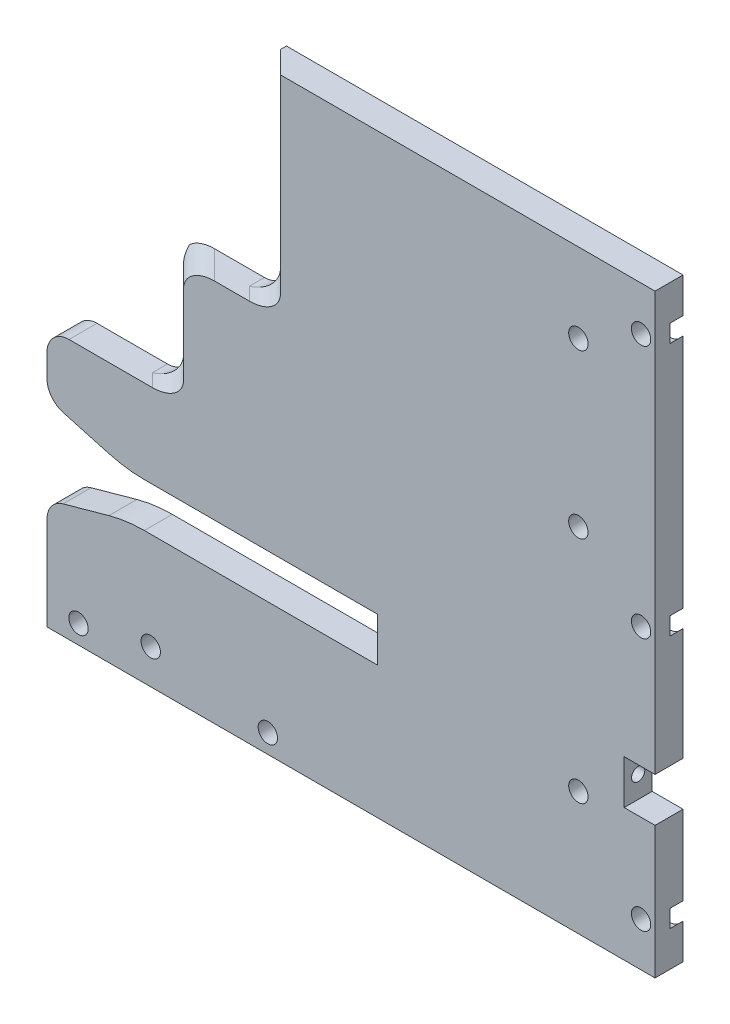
ISO-10303-21;
HEADER;
FILE_DESCRIPTION(('STEP AP214'),'2;1');
FILE_NAME('part.step','',(''),(''),'','','');
FILE_SCHEMA(('AUTOMOTIVE_DESIGN { 1 0 10303 214 1 1 1 1 }'));
ENDSEC;
DATA;
#1=APPLICATION_CONTEXT('core data for automotive mechanical design processes');
#2=APPLICATION_PROTOCOL_DEFINITION('international standard','automotive_design',2000,#1);
#3=PRODUCT_CONTEXT('',#1,'mechanical');
#4=PRODUCT('Part','Part','',(#3));
#5=PRODUCT_RELATED_PRODUCT_CATEGORY('part','',(#4));
#6=PRODUCT_DEFINITION_FORMATION('','',#4);
#7=PRODUCT_DEFINITION_CONTEXT('part definition',#1,'design');
#8=PRODUCT_DEFINITION('design','',#6,#7);
#9=PRODUCT_DEFINITION_SHAPE('','',#8);
#10=(LENGTH_UNIT() NAMED_UNIT(*) SI_UNIT(.MILLI.,.METRE.));
#11=(NAMED_UNIT(*) PLANE_ANGLE_UNIT() SI_UNIT($,.RADIAN.));
#12=(NAMED_UNIT(*) SI_UNIT($,.STERADIAN.) SOLID_ANGLE_UNIT());
#13=UNCERTAINTY_MEASURE_WITH_UNIT(LENGTH_MEASURE(1.E-05),#10,'distance_accuracy_value','');
#14=(GEOMETRIC_REPRESENTATION_CONTEXT(3) GLOBAL_UNCERTAINTY_ASSIGNED_CONTEXT((#13)) GLOBAL_UNIT_ASSIGNED_CONTEXT((#10,
#11,#12)) REPRESENTATION_CONTEXT('',''));
#15=CARTESIAN_POINT('',(0.,0.,0.));
#16=DIRECTION('',(0.,0.,1.));
#17=DIRECTION('',(1.,0.,0.));
#18=AXIS2_PLACEMENT_3D('',#15,#16,#17);
#19=CARTESIAN_POINT('',(0.,135.,6.35));
#20=DIRECTION('',(-1.,0.,0.));
#21=DIRECTION('',(0.,-1.,0.));
#22=AXIS2_PLACEMENT_3D('',#19,#20,#21);
#23=PLANE('',#22);
#24=DIRECTION('',(0.,1.,0.));
#25=VECTOR('',#24,1.);
#26=CARTESIAN_POINT('',(0.,135.,3.));
#27=LINE('',#26,#25);
#28=CARTESIAN_POINT('',(0.,123.004536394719,3.));
#29=VERTEX_POINT('',#28);
#30=CARTESIAN_POINT('',(0.,126.995463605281,3.));
#31=VERTEX_POINT('',#30);
#32=EDGE_CURVE('E271',#29,#31,#27,.T.);
#33=ORIENTED_EDGE('',*,*,#32,.T.);
#34=DIRECTION('',(0.,0.,-1.));
#35=VECTOR('',#34,1.);
#36=CARTESIAN_POINT('',(0.,126.995463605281,0.));
#37=LINE('',#36,#35);
#38=CARTESIAN_POINT('',(0.,126.995463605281,0.));
#39=VERTEX_POINT('',#38);
#40=EDGE_CURVE('E263',#31,#39,#37,.T.);
#41=ORIENTED_EDGE('',*,*,#40,.T.);
#42=DIRECTION('',(0.,1.,0.));
#43=VECTOR('',#42,1.);
#44=CARTESIAN_POINT('',(0.,135.,0.));
#45=LINE('',#44,#43);
#46=CARTESIAN_POINT('',(0.,135.,0.));
#47=VERTEX_POINT('',#46);
#48=EDGE_CURVE('E277',#39,#47,#45,.T.);
#49=ORIENTED_EDGE('',*,*,#48,.T.);
#50=DIRECTION('',(0.,0.,-1.));
#51=VECTOR('',#50,1.);
#52=CARTESIAN_POINT('',(0.,135.,6.35));
#53=LINE('',#52,#51);
#54=CARTESIAN_POINT('',(0.,135.,6.35));
#55=VERTEX_POINT('',#54);
#56=EDGE_CURVE('E431',#55,#47,#53,.T.);
#57=ORIENTED_EDGE('',*,*,#56,.F.);
#58=DIRECTION('',(0.,1.,0.));
#59=VECTOR('',#58,1.);
#60=CARTESIAN_POINT('',(0.,135.,6.35));
#61=LINE('',#60,#59);
#62=CARTESIAN_POINT('',(0.,40.,6.35));
#63=VERTEX_POINT('',#62);
#64=EDGE_CURVE('E390',#63,#55,#61,.T.);
#65=ORIENTED_EDGE('',*,*,#64,.F.);
#66=DIRECTION('',(0.,0.,-1.));
#67=VECTOR('',#66,1.);
#68=CARTESIAN_POINT('',(0.,40.,6.35));
#69=LINE('',#68,#67);
#70=CARTESIAN_POINT('',(0.,40.,0.));
#71=VERTEX_POINT('',#70);
#72=EDGE_CURVE('E309',#63,#71,#69,.T.);
#73=ORIENTED_EDGE('',*,*,#72,.T.);
#74=CARTESIAN_POINT('',(0.,65.5045363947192,0.));
#75=VERTEX_POINT('',#74);
#76=EDGE_CURVE('E290',#71,#75,#45,.T.);
#77=ORIENTED_EDGE('',*,*,#76,.T.);
#78=DIRECTION('',(0.,0.,-1.));
#79=VECTOR('',#78,1.);
#80=CARTESIAN_POINT('',(0.,65.5045363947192,0.));
#81=LINE('',#80,#79);
#82=CARTESIAN_POINT('',(0.,65.5045363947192,3.));
#83=VERTEX_POINT('',#82);
#84=EDGE_CURVE('E307',#75,#83,#81,.F.);
#85=ORIENTED_EDGE('',*,*,#84,.T.);
#86=DIRECTION('',(0.,1.,0.));
#87=VECTOR('',#86,1.);
#88=CARTESIAN_POINT('',(0.,135.,3.));
#89=LINE('',#88,#87);
#90=CARTESIAN_POINT('',(0.,69.4954636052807,3.));
#91=VERTEX_POINT('',#90);
#92=EDGE_CURVE('E272',#83,#91,#89,.T.);
#93=ORIENTED_EDGE('',*,*,#92,.T.);
#94=DIRECTION('',(0.,0.,-1.));
#95=VECTOR('',#94,1.);
#96=CARTESIAN_POINT('',(0.,69.4954636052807,0.));
#97=LINE('',#96,#95);
#98=CARTESIAN_POINT('',(0.,69.4954636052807,0.));
#99=VERTEX_POINT('',#98);
#100=EDGE_CURVE('E334',#91,#99,#97,.T.);
#101=ORIENTED_EDGE('',*,*,#100,.T.);
#102=CARTESIAN_POINT('',(0.,123.004536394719,0.));
#103=VERTEX_POINT('',#102);
#104=EDGE_CURVE('E286',#99,#103,#45,.T.);
#105=ORIENTED_EDGE('',*,*,#104,.T.);
#106=DIRECTION('',(0.,0.,-1.));
#107=VECTOR('',#106,1.);
#108=CARTESIAN_POINT('',(0.,123.004536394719,0.));
#109=LINE('',#108,#107);
#110=EDGE_CURVE('E266',#103,#29,#109,.F.);
#111=ORIENTED_EDGE('',*,*,#110,.T.);
#112=EDGE_LOOP('',(#33,#41,#49,#57,#65,#73,#77,#85,#93,#101,#105,#111));
#113=FACE_BOUND('',#112,.T.);
#114=ADVANCED_FACE('F33',(#113),#23,.F.);
#115=DIRECTION('',(0.,1.,0.));
#116=VECTOR('',#115,1.);
#117=CARTESIAN_POINT('',(0.,135.,3.));
#118=LINE('',#117,#116);
#119=CARTESIAN_POINT('',(0.,8.00453639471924,3.));
#120=VERTEX_POINT('',#119);
#121=CARTESIAN_POINT('',(0.,11.9954636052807,3.));
#122=VERTEX_POINT('',#121);
#123=EDGE_CURVE('E317',#120,#122,#118,.T.);
#124=ORIENTED_EDGE('',*,*,#123,.T.);
#125=DIRECTION('',(0.,0.,-1.));
#126=VECTOR('',#125,1.);
#127=CARTESIAN_POINT('',(0.,11.9954636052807,0.));
#128=LINE('',#127,#126);
#129=CARTESIAN_POINT('',(0.,11.9954636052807,0.));
#130=VERTEX_POINT('',#129);
#131=EDGE_CURVE('E347',#122,#130,#128,.T.);
#132=ORIENTED_EDGE('',*,*,#131,.T.);
#133=CARTESIAN_POINT('',(0.,30.,0.));
#134=VERTEX_POINT('',#133);
#135=EDGE_CURVE('E291',#130,#134,#45,.T.);
#136=ORIENTED_EDGE('',*,*,#135,.T.);
#137=DIRECTION('',(0.,0.,-1.));
#138=VECTOR('',#137,1.);
#139=CARTESIAN_POINT('',(0.,30.,6.35));
#140=LINE('',#139,#138);
#141=CARTESIAN_POINT('',(0.,30.,6.35));
#142=VERTEX_POINT('',#141);
#143=EDGE_CURVE('E360',#142,#134,#140,.T.);
#144=ORIENTED_EDGE('',*,*,#143,.F.);
#145=CARTESIAN_POINT('',(0.,0.,6.35));
#146=VERTEX_POINT('',#145);
#147=EDGE_CURVE('E386',#146,#142,#61,.T.);
#148=ORIENTED_EDGE('',*,*,#147,.F.);
#149=DIRECTION('',(0.,0.,-1.));
#150=VECTOR('',#149,1.);
#151=CARTESIAN_POINT('',(0.,0.,6.35));
#152=LINE('',#151,#150);
#153=CARTESIAN_POINT('',(0.,0.,0.));
#154=VERTEX_POINT('',#153);
#155=EDGE_CURVE('E410',#146,#154,#152,.T.);
#156=ORIENTED_EDGE('',*,*,#155,.T.);
#157=CARTESIAN_POINT('',(0.,8.00453639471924,0.));
#158=VERTEX_POINT('',#157);
#159=EDGE_CURVE('E289',#154,#158,#45,.T.);
#160=ORIENTED_EDGE('',*,*,#159,.T.);
#161=DIRECTION('',(0.,0.,-1.));
#162=VECTOR('',#161,1.);
#163=CARTESIAN_POINT('',(0.,8.00453639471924,0.));
#164=LINE('',#163,#162);
#165=EDGE_CURVE('E345',#158,#120,#164,.F.);
#166=ORIENTED_EDGE('',*,*,#165,.T.);
#167=EDGE_LOOP('',(#124,#132,#136,#144,#148,#156,#160,#166));
#168=FACE_BOUND('',#167,.T.);
#169=ADVANCED_FACE('F600',(#168),#23,.F.);
#170=CARTESIAN_POINT('',(-90.,135.,6.35));
#171=DIRECTION('',(0.,-1.,0.));
#172=DIRECTION('',(0.,0.,-1.));
#173=AXIS2_PLACEMENT_3D('',#170,#171,#172);
#174=PLANE('',#173);
#175=DIRECTION('',(0.,0.,-1.));
#176=VECTOR('',#175,1.);
#177=CARTESIAN_POINT('',(-90.,135.,6.35));
#178=LINE('',#177,#176);
#179=CARTESIAN_POINT('',(-90.,135.,1.35));
#180=VERTEX_POINT('',#179);
#181=CARTESIAN_POINT('',(-90.,135.,0.));
#182=VERTEX_POINT('',#181);
#183=EDGE_CURVE('E429',#180,#182,#178,.T.);
#184=ORIENTED_EDGE('',*,*,#183,.F.);
#185=DIRECTION('',(-0.707106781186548,0.,-0.707106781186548));
#186=VECTOR('',#185,1.);
#187=CARTESIAN_POINT('',(-85.,135.,6.35));
#188=LINE('',#187,#186);
#189=CARTESIAN_POINT('',(-85.,135.,6.35));
#190=VERTEX_POINT('',#189);
#191=EDGE_CURVE('E462',#180,#190,#188,.F.);
#192=ORIENTED_EDGE('',*,*,#191,.T.);
#193=DIRECTION('',(-1.,0.,0.));
#194=VECTOR('',#193,1.);
#195=CARTESIAN_POINT('',(-90.,135.,6.35));
#196=LINE('',#195,#194);
#197=EDGE_CURVE('E389',#55,#190,#196,.T.);
#198=ORIENTED_EDGE('',*,*,#197,.F.);
#199=ORIENTED_EDGE('',*,*,#56,.T.);
#200=DIRECTION('',(-1.,0.,0.));
#201=VECTOR('',#200,1.);
#202=CARTESIAN_POINT('',(-90.,135.,0.));
#203=LINE('',#202,#201);
#204=EDGE_CURVE('E284',#47,#182,#203,.T.);
#205=ORIENTED_EDGE('',*,*,#204,.T.);
#206=EDGE_LOOP('',(#184,#192,#198,#199,#205));
#207=FACE_BOUND('',#206,.T.);
#208=ADVANCED_FACE('F576',(#207),#174,.F.);
#209=CARTESIAN_POINT('',(-90.,87.,6.35));
#210=DIRECTION('',(1.,0.,0.));
#211=DIRECTION('',(0.,0.,-1.));
#212=AXIS2_PLACEMENT_3D('',#209,#210,#211);
#213=PLANE('',#212);
#214=DIRECTION('',(0.,-1.,0.));
#215=VECTOR('',#214,1.);
#216=CARTESIAN_POINT('',(-90.,87.,0.));
#217=LINE('',#216,#215);
#218=CARTESIAN_POINT('',(-90.,92.,0.));
#219=VERTEX_POINT('',#218);
#220=EDGE_CURVE('E301',#182,#219,#217,.T.);
#221=ORIENTED_EDGE('',*,*,#220,.T.);
#222=DIRECTION('',(0.,0.,-1.));
#223=VECTOR('',#222,1.);
#224=CARTESIAN_POINT('',(-90.,92.,1.35));
#225=LINE('',#224,#223);
#226=CARTESIAN_POINT('',(-90.,92.,1.35));
#227=VERTEX_POINT('',#226);
#228=EDGE_CURVE('E500',#219,#227,#225,.F.);
#229=ORIENTED_EDGE('',*,*,#228,.T.);
#230=DIRECTION('',(0.,1.,0.));
#231=VECTOR('',#230,1.);
#232=CARTESIAN_POINT('',(-90.,87.,1.35));
#233=LINE('',#232,#231);
#234=EDGE_CURVE('E460',#227,#180,#233,.T.);
#235=ORIENTED_EDGE('',*,*,#234,.T.);
#236=ORIENTED_EDGE('',*,*,#183,.T.);
#237=EDGE_LOOP('',(#221,#229,#235,#236));
#238=FACE_BOUND('',#237,.T.);
#239=ADVANCED_FACE('F591',(#238),#213,.F.);
#240=CARTESIAN_POINT('',(-112.,87.,6.35));
#241=DIRECTION('',(0.,-1.,0.));
#242=DIRECTION('',(1.,0.,0.));
#243=AXIS2_PLACEMENT_3D('',#240,#241,#242);
#244=PLANE('',#243);
#245=DIRECTION('',(-1.,0.,0.));
#246=VECTOR('',#245,1.);
#247=CARTESIAN_POINT('',(-112.,87.,0.));
#248=LINE('',#247,#246);
#249=CARTESIAN_POINT('',(-95.,87.,0.));
#250=VERTEX_POINT('',#249);
#251=CARTESIAN_POINT('',(-106.278932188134,87.,0.));
#252=VERTEX_POINT('',#251);
#253=EDGE_CURVE('E543',#250,#252,#248,.T.);
#254=ORIENTED_EDGE('',*,*,#253,.T.);
#255=DIRECTION('',(-0.707106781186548,0.,-0.707106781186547));
#256=VECTOR('',#255,1.);
#257=CARTESIAN_POINT('',(-103.464466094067,87.,2.81446609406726));
#258=LINE('',#257,#256);
#259=CARTESIAN_POINT('',(-99.9289321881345,87.,6.35));
#260=VERTEX_POINT('',#259);
#261=EDGE_CURVE('E528',#252,#260,#258,.F.);
#262=ORIENTED_EDGE('',*,*,#261,.T.);
#263=DIRECTION('',(-1.,0.,0.));
#264=VECTOR('',#263,1.);
#265=CARTESIAN_POINT('',(-112.,87.,6.35));
#266=LINE('',#265,#264);
#267=CARTESIAN_POINT('',(-92.0710678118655,87.,6.35));
#268=VERTEX_POINT('',#267);
#269=EDGE_CURVE('E393',#268,#260,#266,.T.);
#270=ORIENTED_EDGE('',*,*,#269,.F.);
#271=DIRECTION('',(0.707106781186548,0.,0.707106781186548));
#272=VECTOR('',#271,1.);
#273=CARTESIAN_POINT('',(-102.035533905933,87.,-3.61446609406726));
#274=LINE('',#273,#272);
#275=CARTESIAN_POINT('',(-95.,87.,3.42106781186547));
#276=VERTEX_POINT('',#275);
#277=EDGE_CURVE('E495',#268,#276,#274,.F.);
#278=ORIENTED_EDGE('',*,*,#277,.T.);
#279=DIRECTION('',(0.,0.,-1.));
#280=VECTOR('',#279,1.);
#281=CARTESIAN_POINT('',(-95.,87.,0.));
#282=LINE('',#281,#280);
#283=EDGE_CURVE('E493',#276,#250,#282,.T.);
#284=ORIENTED_EDGE('',*,*,#283,.T.);
#285=EDGE_LOOP('',(#254,#262,#270,#278,#284));
#286=FACE_BOUND('',#285,.T.);
#287=ADVANCED_FACE('F547',(#286),#244,.F.);
#288=CARTESIAN_POINT('',(-112.,59.,6.35));
#289=DIRECTION('',(1.,0.,0.));
#290=DIRECTION('',(0.,1.,0.));
#291=AXIS2_PLACEMENT_3D('',#288,#289,#290);
#292=PLANE('',#291);
#293=DIRECTION('',(0.,1.,0.));
#294=VECTOR('',#293,1.);
#295=CARTESIAN_POINT('',(-112.,59.,1.34999999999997));
#296=LINE('',#295,#294);
#297=CARTESIAN_POINT('',(-112.,64.,1.34999999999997));
#298=VERTEX_POINT('',#297);
#299=CARTESIAN_POINT('',(-112.,82.,1.34999999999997));
#300=VERTEX_POINT('',#299);
#301=EDGE_CURVE('E458',#298,#300,#296,.T.);
#302=ORIENTED_EDGE('',*,*,#301,.T.);
#303=CARTESIAN_POINT('',(-112.,82.,-5.72106781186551));
#304=DIRECTION('',(1.,0.,0.));
#305=DIRECTION('',(0.,0.,1.));
#306=AXIS2_PLACEMENT_3D('',#303,#304,#305);
#307=ELLIPSE('',#306,7.07106781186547,5.);
#308=CARTESIAN_POINT('',(-112.,84.9384845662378,0.));
#309=VERTEX_POINT('',#308);
#310=EDGE_CURVE('E41',#300,#309,#307,.F.);
#311=ORIENTED_EDGE('',*,*,#310,.T.);
#312=DIRECTION('',(0.,-1.,0.));
#313=VECTOR('',#312,1.);
#314=CARTESIAN_POINT('',(-112.,59.,0.));
#315=LINE('',#314,#313);
#316=CARTESIAN_POINT('',(-112.,64.,0.));
#317=VERTEX_POINT('',#316);
#318=EDGE_CURVE('E545',#309,#317,#315,.T.);
#319=ORIENTED_EDGE('',*,*,#318,.T.);
#320=DIRECTION('',(0.,0.,-1.));
#321=VECTOR('',#320,1.);
#322=CARTESIAN_POINT('',(-112.,64.,1.34999999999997));
#323=LINE('',#322,#321);
#324=EDGE_CURVE('E510',#317,#298,#323,.F.);
#325=ORIENTED_EDGE('',*,*,#324,.T.);
#326=EDGE_LOOP('',(#302,#311,#319,#325));
#327=FACE_BOUND('',#326,.T.);
#328=ADVANCED_FACE('F598',(#327),#292,.F.);
#329=CARTESIAN_POINT('',(-138.,59.,6.35));
#330=DIRECTION('',(0.,-1.,0.));
#331=DIRECTION('',(1.,0.,0.));
#332=AXIS2_PLACEMENT_3D('',#329,#330,#331);
#333=PLANE('',#332);
#334=DIRECTION('',(-1.,0.,0.));
#335=VECTOR('',#334,1.);
#336=CARTESIAN_POINT('',(-138.,59.,6.35));
#337=LINE('',#336,#335);
#338=CARTESIAN_POINT('',(-114.071067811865,59.,6.35));
#339=VERTEX_POINT('',#338);
#340=CARTESIAN_POINT('',(-133.,59.,6.35));
#341=VERTEX_POINT('',#340);
#342=EDGE_CURVE('E396',#339,#341,#337,.T.);
#343=ORIENTED_EDGE('',*,*,#342,.F.);
#344=DIRECTION('',(0.707106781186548,0.,0.707106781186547));
#345=VECTOR('',#344,1.);
#346=CARTESIAN_POINT('',(-126.035533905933,59.,-5.61446609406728));
#347=LINE('',#346,#345);
#348=CARTESIAN_POINT('',(-117.,59.,3.42106781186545));
#349=VERTEX_POINT('',#348);
#350=EDGE_CURVE('E504',#339,#349,#347,.F.);
#351=ORIENTED_EDGE('',*,*,#350,.T.);
#352=DIRECTION('',(0.,0.,-1.));
#353=VECTOR('',#352,1.);
#354=CARTESIAN_POINT('',(-117.,59.,0.));
#355=LINE('',#354,#353);
#356=CARTESIAN_POINT('',(-117.,59.,0.));
#357=VERTEX_POINT('',#356);
#358=EDGE_CURVE('E502',#349,#357,#355,.T.);
#359=ORIENTED_EDGE('',*,*,#358,.T.);
#360=DIRECTION('',(-1.,0.,0.));
#361=VECTOR('',#360,1.);
#362=CARTESIAN_POINT('',(-138.,59.,0.));
#363=LINE('',#362,#361);
#364=CARTESIAN_POINT('',(-133.,59.,0.));
#365=VERTEX_POINT('',#364);
#366=EDGE_CURVE('E550',#357,#365,#363,.T.);
#367=ORIENTED_EDGE('',*,*,#366,.T.);
#368=DIRECTION('',(0.,0.,-1.));
#369=VECTOR('',#368,1.);
#370=CARTESIAN_POINT('',(-133.,59.,6.35));
#371=LINE('',#370,#369);
#372=EDGE_CURVE('E476',#365,#341,#371,.F.);
#373=ORIENTED_EDGE('',*,*,#372,.T.);
#374=EDGE_LOOP('',(#343,#351,#359,#367,#373));
#375=FACE_BOUND('',#374,.T.);
#376=ADVANCED_FACE('F655',(#375),#333,.F.);
#377=CARTESIAN_POINT('',(-138.,40.,6.35));
#378=DIRECTION('',(1.,0.,0.));
#379=DIRECTION('',(0.,0.,-1.));
#380=AXIS2_PLACEMENT_3D('',#377,#378,#379);
#381=PLANE('',#380);
#382=DIRECTION('',(0.,-1.,0.));
#383=VECTOR('',#382,1.);
#384=CARTESIAN_POINT('',(-138.,40.,6.35));
#385=LINE('',#384,#383);
#386=CARTESIAN_POINT('',(-138.,54.,6.35));
#387=VERTEX_POINT('',#386);
#388=CARTESIAN_POINT('',(-138.,48.8004282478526,6.35));
#389=VERTEX_POINT('',#388);
#390=EDGE_CURVE('E398',#387,#389,#385,.T.);
#391=ORIENTED_EDGE('',*,*,#390,.F.);
#392=DIRECTION('',(0.,0.,-1.));
#393=VECTOR('',#392,1.);
#394=CARTESIAN_POINT('',(-138.,54.,6.35));
#395=LINE('',#394,#393);
#396=CARTESIAN_POINT('',(-138.,54.,0.));
#397=VERTEX_POINT('',#396);
#398=EDGE_CURVE('E466',#387,#397,#395,.T.);
#399=ORIENTED_EDGE('',*,*,#398,.T.);
#400=DIRECTION('',(0.,-1.,0.));
#401=VECTOR('',#400,1.);
#402=CARTESIAN_POINT('',(-138.,40.,0.));
#403=LINE('',#402,#401);
#404=CARTESIAN_POINT('',(-138.,48.8004282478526,0.));
#405=VERTEX_POINT('',#404);
#406=EDGE_CURVE('E556',#397,#405,#403,.T.);
#407=ORIENTED_EDGE('',*,*,#406,.T.);
#408=DIRECTION('',(0.,0.,-1.));
#409=VECTOR('',#408,1.);
#410=CARTESIAN_POINT('',(-138.,48.8004282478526,6.35));
#411=LINE('',#410,#409);
#412=EDGE_CURVE('E464',#405,#389,#411,.F.);
#413=ORIENTED_EDGE('',*,*,#412,.T.);
#414=EDGE_LOOP('',(#391,#399,#407,#413));
#415=FACE_BOUND('',#414,.T.);
#416=ADVANCED_FACE('F662',(#415),#381,.F.);
#417=CARTESIAN_POINT('',(-63.,40.,6.35));
#418=DIRECTION('',(0.,1.,0.));
#419=DIRECTION('',(-1.,0.,0.));
#420=AXIS2_PLACEMENT_3D('',#417,#418,#419);
#421=PLANE('',#420);
#422=DIRECTION('',(1.,0.,0.));
#423=VECTOR('',#422,1.);
#424=CARTESIAN_POINT('',(-63.,40.,6.35));
#425=LINE('',#424,#423);
#426=CARTESIAN_POINT('',(-115.910749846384,40.,6.35));
#427=VERTEX_POINT('',#426);
#428=CARTESIAN_POINT('',(-63.,40.,6.35));
#429=VERTEX_POINT('',#428);
#430=EDGE_CURVE('E401',#427,#429,#425,.T.);
#431=ORIENTED_EDGE('',*,*,#430,.F.);
#432=DIRECTION('',(0.,0.,-1.));
#433=VECTOR('',#432,1.);
#434=CARTESIAN_POINT('',(-115.910749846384,40.,6.35));
#435=LINE('',#434,#433);
#436=CARTESIAN_POINT('',(-115.910749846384,40.,0.));
#437=VERTEX_POINT('',#436);
#438=EDGE_CURVE('E433',#427,#437,#435,.T.);
#439=ORIENTED_EDGE('',*,*,#438,.T.);
#440=DIRECTION('',(1.,0.,0.));
#441=VECTOR('',#440,1.);
#442=CARTESIAN_POINT('',(-63.,40.,0.));
#443=LINE('',#442,#441);
#444=CARTESIAN_POINT('',(-63.,40.,0.));
#445=VERTEX_POINT('',#444);
#446=EDGE_CURVE('E559',#437,#445,#443,.T.);
#447=ORIENTED_EDGE('',*,*,#446,.T.);
#448=DIRECTION('',(0.,0.,-1.));
#449=VECTOR('',#448,1.);
#450=CARTESIAN_POINT('',(-63.,40.,6.35));
#451=LINE('',#450,#449);
#452=EDGE_CURVE('E426',#429,#445,#451,.T.);
#453=ORIENTED_EDGE('',*,*,#452,.F.);
#454=EDGE_LOOP('',(#431,#439,#447,#453));
#455=FACE_BOUND('',#454,.T.);
#456=ADVANCED_FACE('F675',(#455),#421,.F.);
#457=CARTESIAN_POINT('',(-63.,30.,6.35));
#458=DIRECTION('',(1.,0.,0.));
#459=DIRECTION('',(0.,0.,-1.));
#460=AXIS2_PLACEMENT_3D('',#457,#458,#459);
#461=PLANE('',#460);
#462=CARTESIAN_POINT('',(-63.,35.,3.175));
#463=DIRECTION('',(-1.,0.,0.));
#464=DIRECTION('',(0.,0.,1.));
#465=AXIS2_PLACEMENT_3D('',#462,#463,#464);
#466=CIRCLE('',#465,1.5);
#467=CARTESIAN_POINT('',(-63.,35.,4.675));
#468=VERTEX_POINT('',#467);
#469=EDGE_CURVE('E375',#468,#468,#466,.T.);
#470=ORIENTED_EDGE('',*,*,#469,.F.);
#471=EDGE_LOOP('',(#470));
#472=FACE_BOUND('',#471,.T.);
#473=DIRECTION('',(0.,-1.,0.));
#474=VECTOR('',#473,1.);
#475=CARTESIAN_POINT('',(-63.,30.,0.));
#476=LINE('',#475,#474);
#477=CARTESIAN_POINT('',(-63.,30.,0.));
#478=VERTEX_POINT('',#477);
#479=EDGE_CURVE('E561',#445,#478,#476,.T.);
#480=ORIENTED_EDGE('',*,*,#479,.T.);
#481=DIRECTION('',(0.,0.,-1.));
#482=VECTOR('',#481,1.);
#483=CARTESIAN_POINT('',(-63.,30.,6.35));
#484=LINE('',#483,#482);
#485=CARTESIAN_POINT('',(-63.,30.,6.35));
#486=VERTEX_POINT('',#485);
#487=EDGE_CURVE('E418',#486,#478,#484,.T.);
#488=ORIENTED_EDGE('',*,*,#487,.F.);
#489=DIRECTION('',(0.,-1.,0.));
#490=VECTOR('',#489,1.);
#491=CARTESIAN_POINT('',(-63.,30.,6.35));
#492=LINE('',#491,#490);
#493=EDGE_CURVE('E403',#429,#486,#492,.T.);
#494=ORIENTED_EDGE('',*,*,#493,.F.);
#495=ORIENTED_EDGE('',*,*,#452,.T.);
#496=EDGE_LOOP('',(#480,#488,#494,#495));
#497=FACE_BOUND('',#496,.T.);
#498=ADVANCED_FACE('F681',(#472,#497),#461,.F.);
#499=CARTESIAN_POINT('',(-138.,30.,6.35));
#500=DIRECTION('',(0.,-1.,0.));
#501=DIRECTION('',(0.,0.,-1.));
#502=AXIS2_PLACEMENT_3D('',#499,#500,#501);
#503=PLANE('',#502);
#504=DIRECTION('',(-1.,0.,0.));
#505=VECTOR('',#504,1.);
#506=CARTESIAN_POINT('',(-138.,30.,0.));
#507=LINE('',#506,#505);
#508=CARTESIAN_POINT('',(-115.910749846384,30.,0.));
#509=VERTEX_POINT('',#508);
#510=EDGE_CURVE('E563',#478,#509,#507,.T.);
#511=ORIENTED_EDGE('',*,*,#510,.T.);
#512=DIRECTION('',(0.,0.,-1.));
#513=VECTOR('',#512,1.);
#514=CARTESIAN_POINT('',(-115.910749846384,30.,6.35));
#515=LINE('',#514,#513);
#516=CARTESIAN_POINT('',(-115.910749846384,30.,6.35));
#517=VERTEX_POINT('',#516);
#518=EDGE_CURVE('E451',#509,#517,#515,.F.);
#519=ORIENTED_EDGE('',*,*,#518,.T.);
#520=DIRECTION('',(-1.,0.,0.));
#521=VECTOR('',#520,1.);
#522=CARTESIAN_POINT('',(-138.,30.,6.35));
#523=LINE('',#522,#521);
#524=EDGE_CURVE('E405',#486,#517,#523,.T.);
#525=ORIENTED_EDGE('',*,*,#524,.F.);
#526=ORIENTED_EDGE('',*,*,#487,.T.);
#527=EDGE_LOOP('',(#511,#519,#525,#526));
#528=FACE_BOUND('',#527,.T.);
#529=ADVANCED_FACE('F737',(#528),#503,.F.);
#530=CARTESIAN_POINT('',(-138.,0.,6.35));
#531=DIRECTION('',(1.,0.,0.));
#532=DIRECTION('',(0.,0.,-1.));
#533=AXIS2_PLACEMENT_3D('',#530,#531,#532);
#534=PLANE('',#533);
#535=DIRECTION('',(0.,-1.,0.));
#536=VECTOR('',#535,1.);
#537=CARTESIAN_POINT('',(-138.,0.,6.35));
#538=LINE('',#537,#536);
#539=CARTESIAN_POINT('',(-138.,21.1995717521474,6.35));
#540=VERTEX_POINT('',#539);
#541=CARTESIAN_POINT('',(-138.,0.,6.35));
#542=VERTEX_POINT('',#541);
#543=EDGE_CURVE('E408',#540,#542,#538,.T.);
#544=ORIENTED_EDGE('',*,*,#543,.F.);
#545=DIRECTION('',(0.,0.,-1.));
#546=VECTOR('',#545,1.);
#547=CARTESIAN_POINT('',(-138.,21.1995717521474,6.35));
#548=LINE('',#547,#546);
#549=CARTESIAN_POINT('',(-138.,21.1995717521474,0.));
#550=VERTEX_POINT('',#549);
#551=EDGE_CURVE('E485',#540,#550,#548,.T.);
#552=ORIENTED_EDGE('',*,*,#551,.T.);
#553=DIRECTION('',(0.,-1.,0.));
#554=VECTOR('',#553,1.);
#555=CARTESIAN_POINT('',(-138.,0.,0.));
#556=LINE('',#555,#554);
#557=CARTESIAN_POINT('',(-138.,0.,0.));
#558=VERTEX_POINT('',#557);
#559=EDGE_CURVE('E565',#550,#558,#556,.T.);
#560=ORIENTED_EDGE('',*,*,#559,.T.);
#561=DIRECTION('',(0.,0.,-1.));
#562=VECTOR('',#561,1.);
#563=CARTESIAN_POINT('',(-138.,0.,6.35));
#564=LINE('',#563,#562);
#565=EDGE_CURVE('E414',#542,#558,#564,.T.);
#566=ORIENTED_EDGE('',*,*,#565,.F.);
#567=EDGE_LOOP('',(#544,#552,#560,#566));
#568=FACE_BOUND('',#567,.T.);
#569=ADVANCED_FACE('F696',(#568),#534,.F.);
#570=CARTESIAN_POINT('',(0.,0.,6.35));
#571=DIRECTION('',(0.,1.,0.));
#572=DIRECTION('',(-1.,0.,0.));
#573=AXIS2_PLACEMENT_3D('',#570,#571,#572);
#574=PLANE('',#573);
#575=DIRECTION('',(1.,0.,0.));
#576=VECTOR('',#575,1.);
#577=CARTESIAN_POINT('',(0.,0.,0.));
#578=LINE('',#577,#576);
#579=EDGE_CURVE('E421',#558,#154,#578,.T.);
#580=ORIENTED_EDGE('',*,*,#579,.T.);
#581=ORIENTED_EDGE('',*,*,#155,.F.);
#582=DIRECTION('',(1.,0.,0.));
#583=VECTOR('',#582,1.);
#584=CARTESIAN_POINT('',(0.,0.,6.35));
#585=LINE('',#584,#583);
#586=EDGE_CURVE('E409',#542,#146,#585,.T.);
#587=ORIENTED_EDGE('',*,*,#586,.F.);
#588=ORIENTED_EDGE('',*,*,#565,.T.);
#589=EDGE_LOOP('',(#580,#581,#587,#588));
#590=FACE_BOUND('',#589,.T.);
#591=ADVANCED_FACE('F697',(#590),#574,.F.);
#592=CARTESIAN_POINT('',(0.,0.,6.35));
#593=DIRECTION('',(0.,0.,-1.));
#594=DIRECTION('',(-1.,0.,0.));
#595=AXIS2_PLACEMENT_3D('',#592,#593,#594);
#596=PLANE('',#595);
#597=CARTESIAN_POINT('',(-87.8703537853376,4.29359135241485,6.35));
#598=DIRECTION('',(0.,0.,-1.));
#599=DIRECTION('',(-1.,0.,0.));
#600=AXIS2_PLACEMENT_3D('',#597,#598,#599);
#601=CIRCLE('',#600,2.20000000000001);
#602=CARTESIAN_POINT('',(-90.0703537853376,4.29359135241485,6.35));
#603=VERTEX_POINT('',#602);
#604=EDGE_CURVE('E1217',#603,#603,#601,.T.);
#605=ORIENTED_EDGE('',*,*,#604,.T.);
#606=EDGE_LOOP('',(#605));
#607=FACE_BOUND('',#606,.T.);
#608=CARTESIAN_POINT('',(-114.451398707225,7.90688835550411,6.35));
#609=DIRECTION('',(0.,0.,-1.));
#610=DIRECTION('',(-1.,0.,0.));
#611=AXIS2_PLACEMENT_3D('',#608,#609,#610);
#612=CIRCLE('',#611,2.20000000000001);
#613=CARTESIAN_POINT('',(-116.651398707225,7.90688835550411,6.35));
#614=VERTEX_POINT('',#613);
#615=EDGE_CURVE('E1229',#614,#614,#612,.T.);
#616=ORIENTED_EDGE('',*,*,#615,.T.);
#617=EDGE_LOOP('',(#616));
#618=FACE_BOUND('',#617,.T.);
#619=CARTESIAN_POINT('',(-130.844995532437,4.29359135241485,6.35));
#620=DIRECTION('',(0.,0.,-1.));
#621=DIRECTION('',(-1.,0.,0.));
#622=AXIS2_PLACEMENT_3D('',#619,#620,#621);
#623=CIRCLE('',#622,2.20000000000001);
#624=CARTESIAN_POINT('',(-133.044995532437,4.29359135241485,6.35));
#625=VERTEX_POINT('',#624);
#626=EDGE_CURVE('E1241',#625,#625,#623,.T.);
#627=ORIENTED_EDGE('',*,*,#626,.T.);
#628=EDGE_LOOP('',(#627));
#629=FACE_BOUND('',#628,.T.);
#630=CARTESIAN_POINT('',(-17.4,117.,6.35));
#631=DIRECTION('',(0.,0.,-1.));
#632=DIRECTION('',(-1.,0.,0.));
#633=AXIS2_PLACEMENT_3D('',#630,#631,#632);
#634=CIRCLE('',#633,2.20000000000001);
#635=CARTESIAN_POINT('',(-19.6,117.,6.35));
#636=VERTEX_POINT('',#635);
#637=EDGE_CURVE('E1253',#636,#636,#634,.T.);
#638=ORIENTED_EDGE('',*,*,#637,.T.);
#639=EDGE_LOOP('',(#638));
#640=FACE_BOUND('',#639,.T.);
#641=CARTESIAN_POINT('',(-17.4,80.,6.35));
#642=DIRECTION('',(0.,0.,-1.));
#643=DIRECTION('',(-1.,0.,0.));
#644=AXIS2_PLACEMENT_3D('',#641,#642,#643);
#645=CIRCLE('',#644,2.20000000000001);
#646=CARTESIAN_POINT('',(-19.6,80.,6.35));
#647=VERTEX_POINT('',#646);
#648=EDGE_CURVE('E1265',#647,#647,#645,.T.);
#649=ORIENTED_EDGE('',*,*,#648,.T.);
#650=EDGE_LOOP('',(#649));
#651=FACE_BOUND('',#650,.T.);
#652=CARTESIAN_POINT('',(-17.4,28.,6.35));
#653=DIRECTION('',(0.,0.,-1.));
#654=DIRECTION('',(-1.,0.,0.));
#655=AXIS2_PLACEMENT_3D('',#652,#653,#654);
#656=CIRCLE('',#655,2.20000000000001);
#657=CARTESIAN_POINT('',(-19.6,28.,6.35));
#658=VERTEX_POINT('',#657);
#659=EDGE_CURVE('E1277',#658,#658,#656,.T.);
#660=ORIENTED_EDGE('',*,*,#659,.T.);
#661=EDGE_LOOP('',(#660));
#662=FACE_BOUND('',#661,.T.);
#663=CARTESIAN_POINT('',(-3.175,125.,6.35));
#664=DIRECTION('',(0.,0.,-1.));
#665=DIRECTION('',(-1.,0.,0.));
#666=AXIS2_PLACEMENT_3D('',#663,#664,#665);
#667=CIRCLE('',#666,2.20000000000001);
#668=CARTESIAN_POINT('',(-5.37500000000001,125.,6.35));
#669=VERTEX_POINT('',#668);
#670=EDGE_CURVE('E1285',#669,#669,#667,.T.);
#671=ORIENTED_EDGE('',*,*,#670,.T.);
#672=EDGE_LOOP('',(#671));
#673=FACE_BOUND('',#672,.T.);
#674=CARTESIAN_POINT('',(-3.17500000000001,67.5,6.35));
#675=DIRECTION('',(0.,0.,-1.));
#676=DIRECTION('',(-1.,0.,0.));
#677=AXIS2_PLACEMENT_3D('',#674,#675,#676);
#678=CIRCLE('',#677,2.20000000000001);
#679=CARTESIAN_POINT('',(-5.37500000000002,67.5,6.35));
#680=VERTEX_POINT('',#679);
#681=EDGE_CURVE('E330',#680,#680,#678,.T.);
#682=ORIENTED_EDGE('',*,*,#681,.T.);
#683=EDGE_LOOP('',(#682));
#684=FACE_BOUND('',#683,.T.);
#685=CARTESIAN_POINT('',(-3.17500000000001,9.99999999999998,6.35));
#686=DIRECTION('',(0.,0.,-1.));
#687=DIRECTION('',(-1.,0.,0.));
#688=AXIS2_PLACEMENT_3D('',#685,#686,#687);
#689=CIRCLE('',#688,2.20000000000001);
#690=CARTESIAN_POINT('',(-5.37500000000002,9.99999999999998,6.35));
#691=VERTEX_POINT('',#690);
#692=EDGE_CURVE('E342',#691,#691,#689,.T.);
#693=ORIENTED_EDGE('',*,*,#692,.T.);
#694=EDGE_LOOP('',(#693));
#695=FACE_BOUND('',#694,.T.);
#696=ORIENTED_EDGE('',*,*,#269,.T.);
#697=CARTESIAN_POINT('',(-99.9289321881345,82.,6.35));
#698=DIRECTION('',(0.,0.,-1.));
#699=DIRECTION('',(1.,0.,0.));
#700=AXIS2_PLACEMENT_3D('',#697,#698,#699);
#701=ELLIPSE('',#700,7.07106781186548,5.);
#702=CARTESIAN_POINT('',(-107.,82.,6.35));
#703=VERTEX_POINT('',#702);
#704=EDGE_CURVE('E531',#260,#703,#701,.F.);
#705=ORIENTED_EDGE('',*,*,#704,.T.);
#706=DIRECTION('',(0.,-1.,0.));
#707=VECTOR('',#706,1.);
#708=CARTESIAN_POINT('',(-107.,0.,6.35));
#709=LINE('',#708,#707);
#710=CARTESIAN_POINT('',(-107.,64.,6.35));
#711=VERTEX_POINT('',#710);
#712=EDGE_CURVE('E456',#703,#711,#709,.T.);
#713=ORIENTED_EDGE('',*,*,#712,.T.);
#714=CARTESIAN_POINT('',(-114.071067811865,64.,6.35));
#715=DIRECTION('',(0.,0.,-1.));
#716=DIRECTION('',(1.,0.,0.));
#717=AXIS2_PLACEMENT_3D('',#714,#715,#716);
#718=ELLIPSE('',#717,7.07106781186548,5.);
#719=EDGE_CURVE('E516',#711,#339,#718,.T.);
#720=ORIENTED_EDGE('',*,*,#719,.T.);
#721=ORIENTED_EDGE('',*,*,#342,.T.);
#722=CARTESIAN_POINT('',(-133.,54.,6.35));
#723=DIRECTION('',(0.,0.,-1.));
#724=DIRECTION('',(-1.,0.,0.));
#725=AXIS2_PLACEMENT_3D('',#722,#723,#724);
#726=CIRCLE('',#725,5.);
#727=EDGE_CURVE('E483',#341,#387,#726,.F.);
#728=ORIENTED_EDGE('',*,*,#727,.T.);
#729=ORIENTED_EDGE('',*,*,#390,.T.);
#730=CARTESIAN_POINT('',(-133.,48.8004282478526,6.35));
#731=DIRECTION('',(0.,0.,-1.));
#732=DIRECTION('',(-1.,0.,0.));
#733=AXIS2_PLACEMENT_3D('',#730,#731,#732);
#734=CIRCLE('',#733,5.);
#735=CARTESIAN_POINT('',(-134.33821931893,43.9828386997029,6.35));
#736=VERTEX_POINT('',#735);
#737=EDGE_CURVE('E479',#389,#736,#734,.F.);
#738=ORIENTED_EDGE('',*,*,#737,.T.);
#739=DIRECTION('',(0.963517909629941,-0.267643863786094,0.));
#740=VECTOR('',#739,1.);
#741=CARTESIAN_POINT('',(-120.,40.,6.35));
#742=LINE('',#741,#740);
#743=CARTESIAN_POINT('',(-123.940065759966,41.0944627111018,6.35));
#744=VERTEX_POINT('',#743);
#745=EDGE_CURVE('E287',#736,#744,#742,.T.);
#746=ORIENTED_EDGE('',*,*,#745,.T.);
#747=CARTESIAN_POINT('',(-115.910749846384,70.,6.35));
#748=DIRECTION('',(0.,0.,-1.));
#749=DIRECTION('',(-1.,0.,0.));
#750=AXIS2_PLACEMENT_3D('',#747,#748,#749);
#751=CIRCLE('',#750,30.);
#752=EDGE_CURVE('E446',#744,#427,#751,.F.);
#753=ORIENTED_EDGE('',*,*,#752,.T.);
#754=ORIENTED_EDGE('',*,*,#430,.T.);
#755=ORIENTED_EDGE('',*,*,#493,.T.);
#756=ORIENTED_EDGE('',*,*,#524,.T.);
#757=CARTESIAN_POINT('',(-115.910749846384,0.,6.35));
#758=DIRECTION('',(0.,0.,-1.));
#759=DIRECTION('',(-1.,0.,0.));
#760=AXIS2_PLACEMENT_3D('',#757,#758,#759);
#761=CIRCLE('',#760,30.);
#762=CARTESIAN_POINT('',(-123.940065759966,28.9055372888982,6.35));
#763=VERTEX_POINT('',#762);
#764=EDGE_CURVE('E444',#517,#763,#761,.F.);
#765=ORIENTED_EDGE('',*,*,#764,.T.);
#766=DIRECTION('',(-0.963517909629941,-0.267643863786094,0.));
#767=VECTOR('',#766,1.);
#768=CARTESIAN_POINT('',(-138.,25.,6.35));
#769=LINE('',#768,#767);
#770=CARTESIAN_POINT('',(-134.33821931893,26.0171613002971,6.35));
#771=VERTEX_POINT('',#770);
#772=EDGE_CURVE('E380',#763,#771,#769,.T.);
#773=ORIENTED_EDGE('',*,*,#772,.T.);
#774=CARTESIAN_POINT('',(-133.,21.1995717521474,6.35));
#775=DIRECTION('',(0.,0.,-1.));
#776=DIRECTION('',(-1.,0.,0.));
#777=AXIS2_PLACEMENT_3D('',#774,#775,#776);
#778=CIRCLE('',#777,5.);
#779=EDGE_CURVE('E481',#771,#540,#778,.F.);
#780=ORIENTED_EDGE('',*,*,#779,.T.);
#781=ORIENTED_EDGE('',*,*,#543,.T.);
#782=ORIENTED_EDGE('',*,*,#586,.T.);
#783=ORIENTED_EDGE('',*,*,#147,.T.);
#784=DIRECTION('',(-1.,0.,0.));
#785=VECTOR('',#784,1.);
#786=CARTESIAN_POINT('',(0.,30.,6.35));
#787=LINE('',#786,#785);
#788=CARTESIAN_POINT('',(-7.,30.,6.35));
#789=VERTEX_POINT('',#788);
#790=EDGE_CURVE('E351',#142,#789,#787,.T.);
#791=ORIENTED_EDGE('',*,*,#790,.T.);
#792=DIRECTION('',(0.,1.,0.));
#793=VECTOR('',#792,1.);
#794=CARTESIAN_POINT('',(-7.,40.,6.35));
#795=LINE('',#794,#793);
#796=CARTESIAN_POINT('',(-7.,40.,6.35));
#797=VERTEX_POINT('',#796);
#798=EDGE_CURVE('E354',#789,#797,#795,.T.);
#799=ORIENTED_EDGE('',*,*,#798,.T.);
#800=DIRECTION('',(1.,0.,0.));
#801=VECTOR('',#800,1.);
#802=CARTESIAN_POINT('',(0.,40.,6.35));
#803=LINE('',#802,#801);
#804=EDGE_CURVE('E357',#797,#63,#803,.T.);
#805=ORIENTED_EDGE('',*,*,#804,.T.);
#806=ORIENTED_EDGE('',*,*,#64,.T.);
#807=ORIENTED_EDGE('',*,*,#197,.T.);
#808=DIRECTION('',(0.,-1.,0.));
#809=VECTOR('',#808,1.);
#810=CARTESIAN_POINT('',(-85.,0.,6.35));
#811=LINE('',#810,#809);
#812=CARTESIAN_POINT('',(-85.,92.,6.35));
#813=VERTEX_POINT('',#812);
#814=EDGE_CURVE('E453',#190,#813,#811,.T.);
#815=ORIENTED_EDGE('',*,*,#814,.T.);
#816=CARTESIAN_POINT('',(-92.0710678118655,92.,6.35));
#817=DIRECTION('',(0.,0.,-1.));
#818=DIRECTION('',(1.,0.,0.));
#819=AXIS2_PLACEMENT_3D('',#816,#817,#818);
#820=ELLIPSE('',#819,7.07106781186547,5.);
#821=EDGE_CURVE('E512',#813,#268,#820,.T.);
#822=ORIENTED_EDGE('',*,*,#821,.T.);
#823=EDGE_LOOP('',(#696,#705,#713,#720,#721,#728,#729,#738,#746,#753,#754,#755,#756,#765,#773,
#780,#781,#782,#783,#791,#799,#805,#806,#807,#815,#822));
#824=FACE_BOUND('',#823,.T.);
#825=ADVANCED_FACE('F533',(#607,#618,#629,#640,#651,#662,#673,#684,#695,#824),#596,.F.);
#826=CARTESIAN_POINT('',(0.,0.,0.));
#827=DIRECTION('',(0.,0.,-1.));
#828=DIRECTION('',(-1.,0.,0.));
#829=AXIS2_PLACEMENT_3D('',#826,#827,#828);
#830=PLANE('',#829);
#831=CARTESIAN_POINT('',(-87.8703537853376,4.29359135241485,0.));
#832=DIRECTION('',(0.,0.,-1.));
#833=DIRECTION('',(-1.,0.,0.));
#834=AXIS2_PLACEMENT_3D('',#831,#832,#833);
#835=CIRCLE('',#834,3.75000000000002);
#836=CARTESIAN_POINT('',(-91.6203537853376,4.29359135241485,0.));
#837=VERTEX_POINT('',#836);
#838=EDGE_CURVE('E1210',#837,#837,#835,.T.);
#839=ORIENTED_EDGE('',*,*,#838,.F.);
#840=EDGE_LOOP('',(#839));
#841=FACE_BOUND('',#840,.T.);
#842=CARTESIAN_POINT('',(-114.451398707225,7.90688835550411,0.));
#843=DIRECTION('',(0.,0.,-1.));
#844=DIRECTION('',(-1.,0.,0.));
#845=AXIS2_PLACEMENT_3D('',#842,#843,#844);
#846=CIRCLE('',#845,3.75000000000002);
#847=CARTESIAN_POINT('',(-118.201398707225,7.90688835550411,0.));
#848=VERTEX_POINT('',#847);
#849=EDGE_CURVE('E1220',#848,#848,#846,.T.);
#850=ORIENTED_EDGE('',*,*,#849,.F.);
#851=EDGE_LOOP('',(#850));
#852=FACE_BOUND('',#851,.T.);
#853=CARTESIAN_POINT('',(-130.844995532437,4.29359135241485,0.));
#854=DIRECTION('',(0.,0.,-1.));
#855=DIRECTION('',(-1.,0.,0.));
#856=AXIS2_PLACEMENT_3D('',#853,#854,#855);
#857=CIRCLE('',#856,3.75);
#858=CARTESIAN_POINT('',(-134.594995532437,4.29359135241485,0.));
#859=VERTEX_POINT('',#858);
#860=EDGE_CURVE('E1232',#859,#859,#857,.T.);
#861=ORIENTED_EDGE('',*,*,#860,.F.);
#862=EDGE_LOOP('',(#861));
#863=FACE_BOUND('',#862,.T.);
#864=CARTESIAN_POINT('',(-17.4,117.,0.));
#865=DIRECTION('',(0.,0.,-1.));
#866=DIRECTION('',(-1.,0.,0.));
#867=AXIS2_PLACEMENT_3D('',#864,#865,#866);
#868=CIRCLE('',#867,3.75000000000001);
#869=CARTESIAN_POINT('',(-21.15,117.,0.));
#870=VERTEX_POINT('',#869);
#871=EDGE_CURVE('E1244',#870,#870,#868,.T.);
#872=ORIENTED_EDGE('',*,*,#871,.F.);
#873=EDGE_LOOP('',(#872));
#874=FACE_BOUND('',#873,.T.);
#875=CARTESIAN_POINT('',(-17.4,80.,0.));
#876=DIRECTION('',(0.,0.,-1.));
#877=DIRECTION('',(-1.,0.,0.));
#878=AXIS2_PLACEMENT_3D('',#875,#876,#877);
#879=CIRCLE('',#878,3.75000000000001);
#880=CARTESIAN_POINT('',(-21.15,80.,0.));
#881=VERTEX_POINT('',#880);
#882=EDGE_CURVE('E1256',#881,#881,#879,.T.);
#883=ORIENTED_EDGE('',*,*,#882,.F.);
#884=EDGE_LOOP('',(#883));
#885=FACE_BOUND('',#884,.T.);
#886=CARTESIAN_POINT('',(-17.4,28.,0.));
#887=DIRECTION('',(0.,0.,-1.));
#888=DIRECTION('',(-1.,0.,0.));
#889=AXIS2_PLACEMENT_3D('',#886,#887,#888);
#890=CIRCLE('',#889,3.75000000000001);
#891=CARTESIAN_POINT('',(-21.15,28.,0.));
#892=VERTEX_POINT('',#891);
#893=EDGE_CURVE('E1268',#892,#892,#890,.T.);
#894=ORIENTED_EDGE('',*,*,#893,.F.);
#895=EDGE_LOOP('',(#894));
#896=FACE_BOUND('',#895,.T.);
#897=ORIENTED_EDGE('',*,*,#318,.F.);
#898=CARTESIAN_POINT('',(-106.278932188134,82.,0.));
#899=DIRECTION('',(0.,0.,-1.));
#900=DIRECTION('',(1.,0.,0.));
#901=AXIS2_PLACEMENT_3D('',#898,#899,#900);
#902=ELLIPSE('',#901,7.07106781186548,5.);
#903=EDGE_CURVE('E11',#309,#252,#902,.T.);
#904=ORIENTED_EDGE('',*,*,#903,.T.);
#905=ORIENTED_EDGE('',*,*,#253,.F.);
#906=CARTESIAN_POINT('',(-95.,92.,0.));
#907=DIRECTION('',(0.,0.,-1.));
#908=DIRECTION('',(-1.,0.,0.));
#909=AXIS2_PLACEMENT_3D('',#906,#907,#908);
#910=CIRCLE('',#909,5.);
#911=EDGE_CURVE('E514',#250,#219,#910,.F.);
#912=ORIENTED_EDGE('',*,*,#911,.T.);
#913=ORIENTED_EDGE('',*,*,#220,.F.);
#914=ORIENTED_EDGE('',*,*,#204,.F.);
#915=ORIENTED_EDGE('',*,*,#48,.F.);
#916=CARTESIAN_POINT('',(-3.175,125.,0.));
#917=DIRECTION('',(0.,0.,-1.));
#918=DIRECTION('',(-1.,0.,0.));
#919=AXIS2_PLACEMENT_3D('',#916,#917,#918);
#920=CIRCLE('',#919,3.75000000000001);
#921=EDGE_CURVE('E259',#103,#39,#920,.T.);
#922=ORIENTED_EDGE('',*,*,#921,.F.);
#923=ORIENTED_EDGE('',*,*,#104,.F.);
#924=CARTESIAN_POINT('',(-3.17500000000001,67.5,0.));
#925=DIRECTION('',(0.,0.,-1.));
#926=DIRECTION('',(-1.,0.,0.));
#927=AXIS2_PLACEMENT_3D('',#924,#925,#926);
#928=CIRCLE('',#927,3.75000000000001);
#929=EDGE_CURVE('E314',#75,#99,#928,.T.);
#930=ORIENTED_EDGE('',*,*,#929,.F.);
#931=ORIENTED_EDGE('',*,*,#76,.F.);
#932=DIRECTION('',(1.,0.,0.));
#933=VECTOR('',#932,1.);
#934=CARTESIAN_POINT('',(0.,40.,0.));
#935=LINE('',#934,#933);
#936=CARTESIAN_POINT('',(-7.,40.,0.));
#937=VERTEX_POINT('',#936);
#938=EDGE_CURVE('E313',#937,#71,#935,.T.);
#939=ORIENTED_EDGE('',*,*,#938,.F.);
#940=DIRECTION('',(0.,1.,0.));
#941=VECTOR('',#940,1.);
#942=CARTESIAN_POINT('',(-7.,40.,0.));
#943=LINE('',#942,#941);
#944=CARTESIAN_POINT('',(-7.,30.,0.));
#945=VERTEX_POINT('',#944);
#946=EDGE_CURVE('E363',#945,#937,#943,.T.);
#947=ORIENTED_EDGE('',*,*,#946,.F.);
#948=DIRECTION('',(-1.,0.,0.));
#949=VECTOR('',#948,1.);
#950=CARTESIAN_POINT('',(0.,30.,0.));
#951=LINE('',#950,#949);
#952=EDGE_CURVE('E350',#134,#945,#951,.T.);
#953=ORIENTED_EDGE('',*,*,#952,.F.);
#954=ORIENTED_EDGE('',*,*,#135,.F.);
#955=CARTESIAN_POINT('',(-3.17500000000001,9.99999999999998,0.));
#956=DIRECTION('',(0.,0.,-1.));
#957=DIRECTION('',(-1.,0.,0.));
#958=AXIS2_PLACEMENT_3D('',#955,#956,#957);
#959=CIRCLE('',#958,3.75000000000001);
#960=EDGE_CURVE('E321',#158,#130,#959,.T.);
#961=ORIENTED_EDGE('',*,*,#960,.F.);
#962=ORIENTED_EDGE('',*,*,#159,.F.);
#963=ORIENTED_EDGE('',*,*,#579,.F.);
#964=ORIENTED_EDGE('',*,*,#559,.F.);
#965=CARTESIAN_POINT('',(-133.,21.1995717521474,0.));
#966=DIRECTION('',(0.,0.,-1.));
#967=DIRECTION('',(-1.,0.,0.));
#968=AXIS2_PLACEMENT_3D('',#965,#966,#967);
#969=CIRCLE('',#968,5.);
#970=CARTESIAN_POINT('',(-134.33821931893,26.0171613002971,0.));
#971=VERTEX_POINT('',#970);
#972=EDGE_CURVE('E471',#550,#971,#969,.T.);
#973=ORIENTED_EDGE('',*,*,#972,.T.);
#974=DIRECTION('',(-0.963517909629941,-0.267643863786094,0.));
#975=VECTOR('',#974,1.);
#976=CARTESIAN_POINT('',(-138.,25.,0.));
#977=LINE('',#976,#975);
#978=CARTESIAN_POINT('',(-123.940065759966,28.9055372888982,0.));
#979=VERTEX_POINT('',#978);
#980=EDGE_CURVE('E378',#979,#971,#977,.T.);
#981=ORIENTED_EDGE('',*,*,#980,.F.);
#982=CARTESIAN_POINT('',(-115.910749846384,0.,0.));
#983=DIRECTION('',(0.,0.,-1.));
#984=DIRECTION('',(-1.,0.,0.));
#985=AXIS2_PLACEMENT_3D('',#982,#983,#984);
#986=CIRCLE('',#985,30.);
#987=EDGE_CURVE('E436',#979,#509,#986,.T.);
#988=ORIENTED_EDGE('',*,*,#987,.T.);
#989=ORIENTED_EDGE('',*,*,#510,.F.);
#990=ORIENTED_EDGE('',*,*,#479,.F.);
#991=ORIENTED_EDGE('',*,*,#446,.F.);
#992=CARTESIAN_POINT('',(-115.910749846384,70.,0.));
#993=DIRECTION('',(0.,0.,-1.));
#994=DIRECTION('',(-1.,0.,0.));
#995=AXIS2_PLACEMENT_3D('',#992,#993,#994);
#996=CIRCLE('',#995,30.);
#997=CARTESIAN_POINT('',(-123.940065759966,41.0944627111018,0.));
#998=VERTEX_POINT('',#997);
#999=EDGE_CURVE('E438',#437,#998,#996,.T.);
#1000=ORIENTED_EDGE('',*,*,#999,.T.);
#1001=DIRECTION('',(0.963517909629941,-0.267643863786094,0.));
#1002=VECTOR('',#1001,1.);
#1003=CARTESIAN_POINT('',(-120.,40.,0.));
#1004=LINE('',#1003,#1002);
#1005=CARTESIAN_POINT('',(-134.33821931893,43.9828386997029,0.));
#1006=VERTEX_POINT('',#1005);
#1007=EDGE_CURVE('E292',#1006,#998,#1004,.T.);
#1008=ORIENTED_EDGE('',*,*,#1007,.F.);
#1009=CARTESIAN_POINT('',(-133.,48.8004282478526,0.));
#1010=DIRECTION('',(0.,0.,-1.));
#1011=DIRECTION('',(-1.,0.,0.));
#1012=AXIS2_PLACEMENT_3D('',#1009,#1010,#1011);
#1013=CIRCLE('',#1012,5.);
#1014=EDGE_CURVE('E469',#1006,#405,#1013,.T.);
#1015=ORIENTED_EDGE('',*,*,#1014,.T.);
#1016=ORIENTED_EDGE('',*,*,#406,.F.);
#1017=CARTESIAN_POINT('',(-133.,54.,0.));
#1018=DIRECTION('',(0.,0.,-1.));
#1019=DIRECTION('',(-1.,0.,0.));
#1020=AXIS2_PLACEMENT_3D('',#1017,#1018,#1019);
#1021=CIRCLE('',#1020,5.);
#1022=EDGE_CURVE('E473',#397,#365,#1021,.T.);
#1023=ORIENTED_EDGE('',*,*,#1022,.T.);
#1024=ORIENTED_EDGE('',*,*,#366,.F.);
#1025=CARTESIAN_POINT('',(-117.,64.,0.));
#1026=DIRECTION('',(0.,0.,-1.));
#1027=DIRECTION('',(-1.,0.,0.));
#1028=AXIS2_PLACEMENT_3D('',#1025,#1026,#1027);
#1029=CIRCLE('',#1028,5.);
#1030=EDGE_CURVE('E518',#357,#317,#1029,.F.);
#1031=ORIENTED_EDGE('',*,*,#1030,.T.);
#1032=EDGE_LOOP('',(#897,#904,#905,#912,#913,#914,#915,#922,#923,#930,#931,#939,#947,#953,#954,
#961,#962,#963,#964,#973,#981,#988,#989,#990,#991,#1000,#1008,#1015,#1016,#1023,#1024,#1031));
#1033=FACE_BOUND('',#1032,.T.);
#1034=ADVANCED_FACE('F281',(#841,#852,#863,#874,#885,#896,#1033),#830,.T.);
#1035=CARTESIAN_POINT('',(-120.,40.,6.35));
#1036=DIRECTION('',(0.267643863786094,0.963517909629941,0.));
#1037=DIRECTION('',(-0.963517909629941,0.267643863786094,0.));
#1038=AXIS2_PLACEMENT_3D('',#1035,#1036,#1037);
#1039=PLANE('',#1038);
#1040=ORIENTED_EDGE('',*,*,#745,.F.);
#1041=DIRECTION('',(0.,0.,-1.));
#1042=VECTOR('',#1041,1.);
#1043=CARTESIAN_POINT('',(-134.33821931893,43.9828386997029,6.35));
#1044=LINE('',#1043,#1042);
#1045=EDGE_CURVE('E490',#736,#1006,#1044,.T.);
#1046=ORIENTED_EDGE('',*,*,#1045,.T.);
#1047=ORIENTED_EDGE('',*,*,#1007,.T.);
#1048=DIRECTION('',(0.,0.,-1.));
#1049=VECTOR('',#1048,1.);
#1050=CARTESIAN_POINT('',(-123.940065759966,41.0944627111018,6.35));
#1051=LINE('',#1050,#1049);
#1052=EDGE_CURVE('E441',#998,#744,#1051,.F.);
#1053=ORIENTED_EDGE('',*,*,#1052,.T.);
#1054=EDGE_LOOP('',(#1040,#1046,#1047,#1053));
#1055=FACE_BOUND('',#1054,.T.);
#1056=ADVANCED_FACE('F667',(#1055),#1039,.F.);
#1057=CARTESIAN_POINT('',(-138.,25.,6.35));
#1058=DIRECTION('',(0.267643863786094,-0.963517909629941,0.));
#1059=DIRECTION('',(0.963517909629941,0.267643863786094,0.));
#1060=AXIS2_PLACEMENT_3D('',#1057,#1058,#1059);
#1061=PLANE('',#1060);
#1062=ORIENTED_EDGE('',*,*,#980,.T.);
#1063=DIRECTION('',(0.,0.,-1.));
#1064=VECTOR('',#1063,1.);
#1065=CARTESIAN_POINT('',(-134.33821931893,26.0171613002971,6.35));
#1066=LINE('',#1065,#1064);
#1067=EDGE_CURVE('E488',#971,#771,#1066,.F.);
#1068=ORIENTED_EDGE('',*,*,#1067,.T.);
#1069=ORIENTED_EDGE('',*,*,#772,.F.);
#1070=DIRECTION('',(0.,0.,-1.));
#1071=VECTOR('',#1070,1.);
#1072=CARTESIAN_POINT('',(-123.940065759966,28.9055372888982,6.35));
#1073=LINE('',#1072,#1071);
#1074=EDGE_CURVE('E448',#763,#979,#1073,.T.);
#1075=ORIENTED_EDGE('',*,*,#1074,.T.);
#1076=EDGE_LOOP('',(#1062,#1068,#1069,#1075));
#1077=FACE_BOUND('',#1076,.T.);
#1078=ADVANCED_FACE('F690',(#1077),#1061,.F.);
#1079=CARTESIAN_POINT('',(0.,35.,3.175));
#1080=DIRECTION('',(-1.,0.,0.));
#1081=DIRECTION('',(0.,0.,1.));
#1082=AXIS2_PLACEMENT_3D('',#1079,#1080,#1081);
#1083=CYLINDRICAL_SURFACE('',#1082,1.5);
#1084=CARTESIAN_POINT('',(-7.,35.,3.175));
#1085=DIRECTION('',(-1.,0.,0.));
#1086=DIRECTION('',(0.,-1.,0.));
#1087=AXIS2_PLACEMENT_3D('',#1084,#1085,#1086);
#1088=CIRCLE('',#1087,1.5);
#1089=CARTESIAN_POINT('',(-7.,33.5,3.175));
#1090=VERTEX_POINT('',#1089);
#1091=EDGE_CURVE('E368',#1090,#1090,#1088,.F.);
#1092=ORIENTED_EDGE('',*,*,#1091,.T.);
#1093=EDGE_LOOP('',(#1092));
#1094=FACE_BOUND('',#1093,.T.);
#1095=ORIENTED_EDGE('',*,*,#469,.T.);
#1096=EDGE_LOOP('',(#1095));
#1097=FACE_BOUND('',#1096,.T.);
#1098=ADVANCED_FACE('F612',(#1094,#1097),#1083,.F.);
#1099=CARTESIAN_POINT('',(-115.910749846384,70.,6.35));
#1100=DIRECTION('',(0.,0.,-1.));
#1101=DIRECTION('',(-1.,0.,0.));
#1102=AXIS2_PLACEMENT_3D('',#1099,#1100,#1101);
#1103=CYLINDRICAL_SURFACE('',#1102,30.);
#1104=ORIENTED_EDGE('',*,*,#752,.F.);
#1105=ORIENTED_EDGE('',*,*,#1052,.F.);
#1106=ORIENTED_EDGE('',*,*,#999,.F.);
#1107=ORIENTED_EDGE('',*,*,#438,.F.);
#1108=EDGE_LOOP('',(#1104,#1105,#1106,#1107));
#1109=FACE_BOUND('',#1108,.T.);
#1110=ADVANCED_FACE('F608',(#1109),#1103,.T.);
#1111=CARTESIAN_POINT('',(-115.910749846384,0.,6.35));
#1112=DIRECTION('',(0.,0.,-1.));
#1113=DIRECTION('',(-1.,0.,0.));
#1114=AXIS2_PLACEMENT_3D('',#1111,#1112,#1113);
#1115=CYLINDRICAL_SURFACE('',#1114,30.);
#1116=ORIENTED_EDGE('',*,*,#764,.F.);
#1117=ORIENTED_EDGE('',*,*,#518,.F.);
#1118=ORIENTED_EDGE('',*,*,#987,.F.);
#1119=ORIENTED_EDGE('',*,*,#1074,.F.);
#1120=EDGE_LOOP('',(#1116,#1117,#1118,#1119));
#1121=FACE_BOUND('',#1120,.T.);
#1122=ADVANCED_FACE('F611',(#1121),#1115,.T.);
#1123=CARTESIAN_POINT('',(-107.,0.,6.35));
#1124=DIRECTION('',(0.707106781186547,0.,-0.707106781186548));
#1125=DIRECTION('',(0.,-1.,0.));
#1126=AXIS2_PLACEMENT_3D('',#1123,#1124,#1125);
#1127=PLANE('',#1126);
#1128=ORIENTED_EDGE('',*,*,#712,.F.);
#1129=DIRECTION('',(0.707106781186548,0.,0.707106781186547));
#1130=VECTOR('',#1129,1.);
#1131=CARTESIAN_POINT('',(-112.,82.,1.34999999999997));
#1132=LINE('',#1131,#1130);
#1133=EDGE_CURVE('E55',#703,#300,#1132,.F.);
#1134=ORIENTED_EDGE('',*,*,#1133,.T.);
#1135=ORIENTED_EDGE('',*,*,#301,.F.);
#1136=DIRECTION('',(-0.707106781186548,0.,-0.707106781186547));
#1137=VECTOR('',#1136,1.);
#1138=CARTESIAN_POINT('',(-107.,64.,6.34999999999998));
#1139=LINE('',#1138,#1137);
#1140=EDGE_CURVE('E507',#298,#711,#1139,.F.);
#1141=ORIENTED_EDGE('',*,*,#1140,.T.);
#1142=EDGE_LOOP('',(#1128,#1134,#1135,#1141));
#1143=FACE_BOUND('',#1142,.T.);
#1144=ADVANCED_FACE('F537',(#1143),#1127,.F.);
#1145=CARTESIAN_POINT('',(-85.,0.,6.35));
#1146=DIRECTION('',(0.707106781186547,0.,-0.707106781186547));
#1147=DIRECTION('',(0.,-1.,0.));
#1148=AXIS2_PLACEMENT_3D('',#1145,#1146,#1147);
#1149=PLANE('',#1148);
#1150=ORIENTED_EDGE('',*,*,#234,.F.);
#1151=DIRECTION('',(-0.707106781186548,0.,-0.707106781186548));
#1152=VECTOR('',#1151,1.);
#1153=CARTESIAN_POINT('',(-85.,92.,6.34999999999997));
#1154=LINE('',#1153,#1152);
#1155=EDGE_CURVE('E498',#227,#813,#1154,.F.);
#1156=ORIENTED_EDGE('',*,*,#1155,.T.);
#1157=ORIENTED_EDGE('',*,*,#814,.F.);
#1158=ORIENTED_EDGE('',*,*,#191,.F.);
#1159=EDGE_LOOP('',(#1150,#1156,#1157,#1158));
#1160=FACE_BOUND('',#1159,.T.);
#1161=ADVANCED_FACE('F580',(#1160),#1149,.F.);
#1162=CARTESIAN_POINT('',(-133.,54.,6.35));
#1163=DIRECTION('',(0.,0.,-1.));
#1164=DIRECTION('',(-1.,0.,0.));
#1165=AXIS2_PLACEMENT_3D('',#1162,#1163,#1164);
#1166=CYLINDRICAL_SURFACE('',#1165,5.);
#1167=ORIENTED_EDGE('',*,*,#727,.F.);
#1168=ORIENTED_EDGE('',*,*,#372,.F.);
#1169=ORIENTED_EDGE('',*,*,#1022,.F.);
#1170=ORIENTED_EDGE('',*,*,#398,.F.);
#1171=EDGE_LOOP('',(#1167,#1168,#1169,#1170));
#1172=FACE_BOUND('',#1171,.T.);
#1173=ADVANCED_FACE('F621',(#1172),#1166,.T.);
#1174=CARTESIAN_POINT('',(-133.,21.1995717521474,6.35));
#1175=DIRECTION('',(0.,0.,-1.));
#1176=DIRECTION('',(-1.,0.,0.));
#1177=AXIS2_PLACEMENT_3D('',#1174,#1175,#1176);
#1178=CYLINDRICAL_SURFACE('',#1177,5.);
#1179=ORIENTED_EDGE('',*,*,#779,.F.);
#1180=ORIENTED_EDGE('',*,*,#1067,.F.);
#1181=ORIENTED_EDGE('',*,*,#972,.F.);
#1182=ORIENTED_EDGE('',*,*,#551,.F.);
#1183=EDGE_LOOP('',(#1179,#1180,#1181,#1182));
#1184=FACE_BOUND('',#1183,.T.);
#1185=ADVANCED_FACE('F624',(#1184),#1178,.T.);
#1186=CARTESIAN_POINT('',(-133.,48.8004282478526,6.35));
#1187=DIRECTION('',(0.,0.,-1.));
#1188=DIRECTION('',(-1.,0.,0.));
#1189=AXIS2_PLACEMENT_3D('',#1186,#1187,#1188);
#1190=CYLINDRICAL_SURFACE('',#1189,5.);
#1191=ORIENTED_EDGE('',*,*,#737,.F.);
#1192=ORIENTED_EDGE('',*,*,#412,.F.);
#1193=ORIENTED_EDGE('',*,*,#1014,.F.);
#1194=ORIENTED_EDGE('',*,*,#1045,.F.);
#1195=EDGE_LOOP('',(#1191,#1192,#1193,#1194));
#1196=FACE_BOUND('',#1195,.T.);
#1197=ADVANCED_FACE('F628',(#1196),#1190,.T.);
#1198=CARTESIAN_POINT('',(-95.,92.,6.35));
#1199=DIRECTION('',(0.,0.,1.));
#1200=DIRECTION('',(1.,0.,0.));
#1201=AXIS2_PLACEMENT_3D('',#1198,#1199,#1200);
#1202=CYLINDRICAL_SURFACE('',#1201,5.);
#1203=ORIENTED_EDGE('',*,*,#911,.F.);
#1204=ORIENTED_EDGE('',*,*,#283,.F.);
#1205=CARTESIAN_POINT('',(-95.,92.,3.42106781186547));
#1206=DIRECTION('',(0.38268343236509,0.,0.923879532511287));
#1207=DIRECTION('',(-0.923879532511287,0.,0.38268343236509));
#1208=AXIS2_PLACEMENT_3D('',#1205,#1206,#1207);
#1209=ELLIPSE('',#1208,5.41196100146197,5.);
#1210=EDGE_CURVE('E379',#227,#276,#1209,.F.);
#1211=ORIENTED_EDGE('',*,*,#1210,.F.);
#1212=ORIENTED_EDGE('',*,*,#228,.F.);
#1213=EDGE_LOOP('',(#1203,#1204,#1211,#1212));
#1214=FACE_BOUND('',#1213,.T.);
#1215=ADVANCED_FACE('F589',(#1214),#1202,.F.);
#1216=CARTESIAN_POINT('',(-102.035533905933,92.,-3.61446609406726));
#1217=DIRECTION('',(0.707106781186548,0.,0.707106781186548));
#1218=DIRECTION('',(0.707106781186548,0.,-0.707106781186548));
#1219=AXIS2_PLACEMENT_3D('',#1216,#1217,#1218);
#1220=CYLINDRICAL_SURFACE('',#1219,5.);
#1221=ORIENTED_EDGE('',*,*,#821,.F.);
#1222=ORIENTED_EDGE('',*,*,#1155,.F.);
#1223=ORIENTED_EDGE('',*,*,#1210,.T.);
#1224=ORIENTED_EDGE('',*,*,#277,.F.);
#1225=EDGE_LOOP('',(#1221,#1222,#1223,#1224));
#1226=FACE_BOUND('',#1225,.T.);
#1227=ADVANCED_FACE('F585',(#1226),#1220,.F.);
#1228=CARTESIAN_POINT('',(-117.,64.,6.35));
#1229=DIRECTION('',(0.,0.,1.));
#1230=DIRECTION('',(1.,0.,0.));
#1231=AXIS2_PLACEMENT_3D('',#1228,#1229,#1230);
#1232=CYLINDRICAL_SURFACE('',#1231,5.);
#1233=ORIENTED_EDGE('',*,*,#1030,.F.);
#1234=ORIENTED_EDGE('',*,*,#358,.F.);
#1235=CARTESIAN_POINT('',(-117.,64.,3.42106781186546));
#1236=DIRECTION('',(0.38268343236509,0.,0.923879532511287));
#1237=DIRECTION('',(-0.923879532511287,0.,0.38268343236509));
#1238=AXIS2_PLACEMENT_3D('',#1235,#1236,#1237);
#1239=ELLIPSE('',#1238,5.41196100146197,5.);
#1240=EDGE_CURVE('E522',#298,#349,#1239,.F.);
#1241=ORIENTED_EDGE('',*,*,#1240,.F.);
#1242=ORIENTED_EDGE('',*,*,#324,.F.);
#1243=EDGE_LOOP('',(#1233,#1234,#1241,#1242));
#1244=FACE_BOUND('',#1243,.T.);
#1245=ADVANCED_FACE('F635',(#1244),#1232,.F.);
#1246=CARTESIAN_POINT('',(-126.035533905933,64.,-5.61446609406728));
#1247=DIRECTION('',(0.707106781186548,0.,0.707106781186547));
#1248=DIRECTION('',(0.707106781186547,0.,-0.707106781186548));
#1249=AXIS2_PLACEMENT_3D('',#1246,#1247,#1248);
#1250=CYLINDRICAL_SURFACE('',#1249,5.);
#1251=ORIENTED_EDGE('',*,*,#719,.F.);
#1252=ORIENTED_EDGE('',*,*,#1140,.F.);
#1253=ORIENTED_EDGE('',*,*,#1240,.T.);
#1254=ORIENTED_EDGE('',*,*,#350,.F.);
#1255=EDGE_LOOP('',(#1251,#1252,#1253,#1254));
#1256=FACE_BOUND('',#1255,.T.);
#1257=ADVANCED_FACE('F638',(#1256),#1250,.F.);
#1258=CARTESIAN_POINT('',(-7.,40.,6.35));
#1259=DIRECTION('',(-1.,0.,0.));
#1260=DIRECTION('',(0.,-1.,0.));
#1261=AXIS2_PLACEMENT_3D('',#1258,#1259,#1260);
#1262=PLANE('',#1261);
#1263=ORIENTED_EDGE('',*,*,#946,.T.);
#1264=DIRECTION('',(0.,0.,-1.));
#1265=VECTOR('',#1264,1.);
#1266=CARTESIAN_POINT('',(-7.,40.,6.35));
#1267=LINE('',#1266,#1265);
#1268=EDGE_CURVE('E369',#797,#937,#1267,.T.);
#1269=ORIENTED_EDGE('',*,*,#1268,.F.);
#1270=ORIENTED_EDGE('',*,*,#798,.F.);
#1271=DIRECTION('',(0.,0.,-1.));
#1272=VECTOR('',#1271,1.);
#1273=CARTESIAN_POINT('',(-7.,30.,6.35));
#1274=LINE('',#1273,#1272);
#1275=EDGE_CURVE('E371',#789,#945,#1274,.T.);
#1276=ORIENTED_EDGE('',*,*,#1275,.T.);
#1277=EDGE_LOOP('',(#1263,#1269,#1270,#1276));
#1278=FACE_BOUND('',#1277,.T.);
#1279=ORIENTED_EDGE('',*,*,#1091,.F.);
#1280=EDGE_LOOP('',(#1279));
#1281=FACE_BOUND('',#1280,.T.);
#1282=ADVANCED_FACE('F640',(#1278,#1281),#1262,.F.);
#1283=CARTESIAN_POINT('',(0.,40.,6.35));
#1284=DIRECTION('',(0.,1.,0.));
#1285=DIRECTION('',(0.,0.,1.));
#1286=AXIS2_PLACEMENT_3D('',#1283,#1284,#1285);
#1287=PLANE('',#1286);
#1288=ORIENTED_EDGE('',*,*,#938,.T.);
#1289=ORIENTED_EDGE('',*,*,#72,.F.);
#1290=ORIENTED_EDGE('',*,*,#804,.F.);
#1291=ORIENTED_EDGE('',*,*,#1268,.T.);
#1292=EDGE_LOOP('',(#1288,#1289,#1290,#1291));
#1293=FACE_BOUND('',#1292,.T.);
#1294=ADVANCED_FACE('F706',(#1293),#1287,.F.);
#1295=CARTESIAN_POINT('',(0.,30.,6.35));
#1296=DIRECTION('',(0.,-1.,0.));
#1297=DIRECTION('',(0.,0.,-1.));
#1298=AXIS2_PLACEMENT_3D('',#1295,#1296,#1297);
#1299=PLANE('',#1298);
#1300=ORIENTED_EDGE('',*,*,#952,.T.);
#1301=ORIENTED_EDGE('',*,*,#1275,.F.);
#1302=ORIENTED_EDGE('',*,*,#790,.F.);
#1303=ORIENTED_EDGE('',*,*,#143,.T.);
#1304=EDGE_LOOP('',(#1300,#1301,#1302,#1303));
#1305=FACE_BOUND('',#1304,.T.);
#1306=ADVANCED_FACE('F701',(#1305),#1299,.F.);
#1307=CARTESIAN_POINT('',(-0.974999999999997,9.99999999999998,3.));
#1308=DIRECTION('',(0.,0.,1.));
#1309=DIRECTION('',(1.,0.,0.));
#1310=AXIS2_PLACEMENT_3D('',#1307,#1308,#1309);
#1311=PLANE('',#1310);
#1312=CARTESIAN_POINT('',(-3.17500000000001,9.99999999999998,3.));
#1313=DIRECTION('',(0.,0.,-1.));
#1314=DIRECTION('',(-1.,0.,0.));
#1315=AXIS2_PLACEMENT_3D('',#1312,#1313,#1314);
#1316=CIRCLE('',#1315,2.20000000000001);
#1317=CARTESIAN_POINT('',(-5.37500000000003,9.99999999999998,3.));
#1318=VERTEX_POINT('',#1317);
#1319=EDGE_CURVE('E339',#1318,#1318,#1316,.T.);
#1320=ORIENTED_EDGE('',*,*,#1319,.F.);
#1321=EDGE_LOOP('',(#1320));
#1322=FACE_BOUND('',#1321,.T.);
#1323=CARTESIAN_POINT('',(-3.17500000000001,9.99999999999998,3.));
#1324=DIRECTION('',(0.,0.,-1.));
#1325=DIRECTION('',(-1.,0.,0.));
#1326=AXIS2_PLACEMENT_3D('',#1323,#1324,#1325);
#1327=CIRCLE('',#1326,3.75000000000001);
#1328=EDGE_CURVE('E336',#120,#122,#1327,.T.);
#1329=ORIENTED_EDGE('',*,*,#1328,.T.);
#1330=ORIENTED_EDGE('',*,*,#123,.F.);
#1331=EDGE_LOOP('',(#1329,#1330));
#1332=FACE_BOUND('',#1331,.T.);
#1333=ADVANCED_FACE('F713',(#1322,#1332),#1311,.F.);
#1334=CARTESIAN_POINT('',(-3.17500000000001,9.99999999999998,0.));
#1335=DIRECTION('',(0.,0.,-1.));
#1336=DIRECTION('',(-1.,0.,0.));
#1337=AXIS2_PLACEMENT_3D('',#1334,#1335,#1336);
#1338=CYLINDRICAL_SURFACE('',#1337,3.75000000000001);
#1339=ORIENTED_EDGE('',*,*,#1328,.F.);
#1340=ORIENTED_EDGE('',*,*,#165,.F.);
#1341=ORIENTED_EDGE('',*,*,#960,.T.);
#1342=ORIENTED_EDGE('',*,*,#131,.F.);
#1343=EDGE_LOOP('',(#1339,#1340,#1341,#1342));
#1344=FACE_BOUND('',#1343,.T.);
#1345=ADVANCED_FACE('F887',(#1344),#1338,.F.);
#1346=CARTESIAN_POINT('',(-3.17500000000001,9.99999999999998,0.));
#1347=DIRECTION('',(0.,0.,-1.));
#1348=DIRECTION('',(-1.,0.,0.));
#1349=AXIS2_PLACEMENT_3D('',#1346,#1347,#1348);
#1350=CYLINDRICAL_SURFACE('',#1349,2.20000000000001);
#1351=ORIENTED_EDGE('',*,*,#692,.F.);
#1352=EDGE_LOOP('',(#1351));
#1353=FACE_BOUND('',#1352,.T.);
#1354=ORIENTED_EDGE('',*,*,#1319,.T.);
#1355=EDGE_LOOP('',(#1354));
#1356=FACE_BOUND('',#1355,.T.);
#1357=ADVANCED_FACE('F717',(#1353,#1356),#1350,.F.);
#1358=CARTESIAN_POINT('',(-0.974999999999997,67.5,3.));
#1359=DIRECTION('',(0.,0.,1.));
#1360=DIRECTION('',(1.,0.,0.));
#1361=AXIS2_PLACEMENT_3D('',#1358,#1359,#1360);
#1362=PLANE('',#1361);
#1363=CARTESIAN_POINT('',(-3.17500000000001,67.5,3.));
#1364=DIRECTION('',(0.,0.,-1.));
#1365=DIRECTION('',(-1.,0.,0.));
#1366=AXIS2_PLACEMENT_3D('',#1363,#1364,#1365);
#1367=CIRCLE('',#1366,2.20000000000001);
#1368=CARTESIAN_POINT('',(-5.37500000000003,67.5,3.));
#1369=VERTEX_POINT('',#1368);
#1370=EDGE_CURVE('E327',#1369,#1369,#1367,.T.);
#1371=ORIENTED_EDGE('',*,*,#1370,.F.);
#1372=EDGE_LOOP('',(#1371));
#1373=FACE_BOUND('',#1372,.T.);
#1374=CARTESIAN_POINT('',(-3.17500000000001,67.5,3.));
#1375=DIRECTION('',(0.,0.,-1.));
#1376=DIRECTION('',(-1.,0.,0.));
#1377=AXIS2_PLACEMENT_3D('',#1374,#1375,#1376);
#1378=CIRCLE('',#1377,3.75000000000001);
#1379=EDGE_CURVE('E279',#83,#91,#1378,.T.);
#1380=ORIENTED_EDGE('',*,*,#1379,.T.);
#1381=ORIENTED_EDGE('',*,*,#92,.F.);
#1382=EDGE_LOOP('',(#1380,#1381));
#1383=FACE_BOUND('',#1382,.T.);
#1384=ADVANCED_FACE('F905',(#1373,#1383),#1362,.F.);
#1385=CARTESIAN_POINT('',(-3.17500000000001,67.5,0.));
#1386=DIRECTION('',(0.,0.,-1.));
#1387=DIRECTION('',(-1.,0.,0.));
#1388=AXIS2_PLACEMENT_3D('',#1385,#1386,#1387);
#1389=CYLINDRICAL_SURFACE('',#1388,3.75000000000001);
#1390=ORIENTED_EDGE('',*,*,#1379,.F.);
#1391=ORIENTED_EDGE('',*,*,#84,.F.);
#1392=ORIENTED_EDGE('',*,*,#929,.T.);
#1393=ORIENTED_EDGE('',*,*,#100,.F.);
#1394=EDGE_LOOP('',(#1390,#1391,#1392,#1393));
#1395=FACE_BOUND('',#1394,.T.);
#1396=ADVANCED_FACE('F914',(#1395),#1389,.F.);
#1397=CARTESIAN_POINT('',(-3.17500000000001,67.5,0.));
#1398=DIRECTION('',(0.,0.,-1.));
#1399=DIRECTION('',(-1.,0.,0.));
#1400=AXIS2_PLACEMENT_3D('',#1397,#1398,#1399);
#1401=CYLINDRICAL_SURFACE('',#1400,2.20000000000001);
#1402=ORIENTED_EDGE('',*,*,#681,.F.);
#1403=EDGE_LOOP('',(#1402));
#1404=FACE_BOUND('',#1403,.T.);
#1405=ORIENTED_EDGE('',*,*,#1370,.T.);
#1406=EDGE_LOOP('',(#1405));
#1407=FACE_BOUND('',#1406,.T.);
#1408=ADVANCED_FACE('F924',(#1404,#1407),#1401,.F.);
#1409=CARTESIAN_POINT('',(-0.974999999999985,125.,3.));
#1410=DIRECTION('',(0.,0.,1.));
#1411=DIRECTION('',(1.,0.,0.));
#1412=AXIS2_PLACEMENT_3D('',#1409,#1410,#1411);
#1413=PLANE('',#1412);
#1414=CARTESIAN_POINT('',(-3.175,125.,3.));
#1415=DIRECTION('',(0.,0.,-1.));
#1416=DIRECTION('',(-1.,0.,0.));
#1417=AXIS2_PLACEMENT_3D('',#1414,#1415,#1416);
#1418=CIRCLE('',#1417,2.20000000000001);
#1419=CARTESIAN_POINT('',(-5.37500000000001,125.,3.));
#1420=VERTEX_POINT('',#1419);
#1421=EDGE_CURVE('E1282',#1420,#1420,#1418,.T.);
#1422=ORIENTED_EDGE('',*,*,#1421,.F.);
#1423=EDGE_LOOP('',(#1422));
#1424=FACE_BOUND('',#1423,.T.);
#1425=CARTESIAN_POINT('',(-3.175,125.,3.));
#1426=DIRECTION('',(0.,0.,-1.));
#1427=DIRECTION('',(-1.,0.,0.));
#1428=AXIS2_PLACEMENT_3D('',#1425,#1426,#1427);
#1429=CIRCLE('',#1428,3.75000000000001);
#1430=EDGE_CURVE('E1279',#29,#31,#1429,.T.);
#1431=ORIENTED_EDGE('',*,*,#1430,.T.);
#1432=ORIENTED_EDGE('',*,*,#32,.F.);
#1433=EDGE_LOOP('',(#1431,#1432));
#1434=FACE_BOUND('',#1433,.T.);
#1435=ADVANCED_FACE('F933',(#1424,#1434),#1413,.F.);
#1436=CARTESIAN_POINT('',(-3.175,125.,0.));
#1437=DIRECTION('',(0.,0.,-1.));
#1438=DIRECTION('',(-1.,0.,0.));
#1439=AXIS2_PLACEMENT_3D('',#1436,#1437,#1438);
#1440=CYLINDRICAL_SURFACE('',#1439,3.75000000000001);
#1441=ORIENTED_EDGE('',*,*,#1430,.F.);
#1442=ORIENTED_EDGE('',*,*,#110,.F.);
#1443=ORIENTED_EDGE('',*,*,#921,.T.);
#1444=ORIENTED_EDGE('',*,*,#40,.F.);
#1445=EDGE_LOOP('',(#1441,#1442,#1443,#1444));
#1446=FACE_BOUND('',#1445,.T.);
#1447=ADVANCED_FACE('F262',(#1446),#1440,.F.);
#1448=CARTESIAN_POINT('',(-3.175,125.,0.));
#1449=DIRECTION('',(0.,0.,-1.));
#1450=DIRECTION('',(-1.,0.,0.));
#1451=AXIS2_PLACEMENT_3D('',#1448,#1449,#1450);
#1452=CYLINDRICAL_SURFACE('',#1451,2.20000000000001);
#1453=ORIENTED_EDGE('',*,*,#670,.F.);
#1454=EDGE_LOOP('',(#1453));
#1455=FACE_BOUND('',#1454,.T.);
#1456=ORIENTED_EDGE('',*,*,#1421,.T.);
#1457=EDGE_LOOP('',(#1456));
#1458=FACE_BOUND('',#1457,.T.);
#1459=ADVANCED_FACE('F952',(#1455,#1458),#1452,.F.);
#1460=CARTESIAN_POINT('',(-17.4,28.,0.));
#1461=DIRECTION('',(0.,0.,-1.));
#1462=DIRECTION('',(-1.,0.,0.));
#1463=AXIS2_PLACEMENT_3D('',#1460,#1461,#1462);
#1464=CYLINDRICAL_SURFACE('',#1463,2.20000000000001);
#1465=ORIENTED_EDGE('',*,*,#659,.F.);
#1466=EDGE_LOOP('',(#1465));
#1467=FACE_BOUND('',#1466,.T.);
#1468=CARTESIAN_POINT('',(-17.4,28.,3.));
#1469=DIRECTION('',(0.,0.,-1.));
#1470=DIRECTION('',(-1.,0.,0.));
#1471=AXIS2_PLACEMENT_3D('',#1468,#1469,#1470);
#1472=CIRCLE('',#1471,2.20000000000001);
#1473=CARTESIAN_POINT('',(-19.6,28.,3.));
#1474=VERTEX_POINT('',#1473);
#1475=EDGE_CURVE('E1274',#1474,#1474,#1472,.T.);
#1476=ORIENTED_EDGE('',*,*,#1475,.T.);
#1477=EDGE_LOOP('',(#1476));
#1478=FACE_BOUND('',#1477,.T.);
#1479=ADVANCED_FACE('F961',(#1467,#1478),#1464,.F.);
#1480=CARTESIAN_POINT('',(-15.2,28.,3.));
#1481=DIRECTION('',(0.,0.,1.));
#1482=DIRECTION('',(1.,0.,0.));
#1483=AXIS2_PLACEMENT_3D('',#1480,#1481,#1482);
#1484=PLANE('',#1483);
#1485=ORIENTED_EDGE('',*,*,#1475,.F.);
#1486=EDGE_LOOP('',(#1485));
#1487=FACE_BOUND('',#1486,.T.);
#1488=CARTESIAN_POINT('',(-17.4,28.,3.));
#1489=DIRECTION('',(0.,0.,-1.));
#1490=DIRECTION('',(-1.,0.,0.));
#1491=AXIS2_PLACEMENT_3D('',#1488,#1489,#1490);
#1492=CIRCLE('',#1491,3.75000000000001);
#1493=CARTESIAN_POINT('',(-21.15,28.,3.));
#1494=VERTEX_POINT('',#1493);
#1495=EDGE_CURVE('E1271',#1494,#1494,#1492,.T.);
#1496=ORIENTED_EDGE('',*,*,#1495,.T.);
#1497=EDGE_LOOP('',(#1496));
#1498=FACE_BOUND('',#1497,.T.);
#1499=ADVANCED_FACE('F971',(#1487,#1498),#1484,.F.);
#1500=CARTESIAN_POINT('',(-17.4,28.,0.));
#1501=DIRECTION('',(0.,0.,-1.));
#1502=DIRECTION('',(-1.,0.,0.));
#1503=AXIS2_PLACEMENT_3D('',#1500,#1501,#1502);
#1504=CYLINDRICAL_SURFACE('',#1503,3.75000000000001);
#1505=ORIENTED_EDGE('',*,*,#1495,.F.);
#1506=EDGE_LOOP('',(#1505));
#1507=FACE_BOUND('',#1506,.T.);
#1508=ORIENTED_EDGE('',*,*,#893,.T.);
#1509=EDGE_LOOP('',(#1508));
#1510=FACE_BOUND('',#1509,.T.);
#1511=ADVANCED_FACE('F981',(#1507,#1510),#1504,.F.);
#1512=CARTESIAN_POINT('',(-17.4,80.,0.));
#1513=DIRECTION('',(0.,0.,-1.));
#1514=DIRECTION('',(-1.,0.,0.));
#1515=AXIS2_PLACEMENT_3D('',#1512,#1513,#1514);
#1516=CYLINDRICAL_SURFACE('',#1515,2.20000000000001);
#1517=ORIENTED_EDGE('',*,*,#648,.F.);
#1518=EDGE_LOOP('',(#1517));
#1519=FACE_BOUND('',#1518,.T.);
#1520=CARTESIAN_POINT('',(-17.4,80.,3.));
#1521=DIRECTION('',(0.,0.,-1.));
#1522=DIRECTION('',(-1.,0.,0.));
#1523=AXIS2_PLACEMENT_3D('',#1520,#1521,#1522);
#1524=CIRCLE('',#1523,2.20000000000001);
#1525=CARTESIAN_POINT('',(-19.6,80.,3.));
#1526=VERTEX_POINT('',#1525);
#1527=EDGE_CURVE('E1262',#1526,#1526,#1524,.T.);
#1528=ORIENTED_EDGE('',*,*,#1527,.T.);
#1529=EDGE_LOOP('',(#1528));
#1530=FACE_BOUND('',#1529,.T.);
#1531=ADVANCED_FACE('F991',(#1519,#1530),#1516,.F.);
#1532=CARTESIAN_POINT('',(-15.2,80.,3.));
#1533=DIRECTION('',(0.,0.,1.));
#1534=DIRECTION('',(1.,0.,0.));
#1535=AXIS2_PLACEMENT_3D('',#1532,#1533,#1534);
#1536=PLANE('',#1535);
#1537=ORIENTED_EDGE('',*,*,#1527,.F.);
#1538=EDGE_LOOP('',(#1537));
#1539=FACE_BOUND('',#1538,.T.);
#1540=CARTESIAN_POINT('',(-17.4,80.,3.));
#1541=DIRECTION('',(0.,0.,-1.));
#1542=DIRECTION('',(-1.,0.,0.));
#1543=AXIS2_PLACEMENT_3D('',#1540,#1541,#1542);
#1544=CIRCLE('',#1543,3.75000000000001);
#1545=CARTESIAN_POINT('',(-21.15,80.,3.));
#1546=VERTEX_POINT('',#1545);
#1547=EDGE_CURVE('E1259',#1546,#1546,#1544,.T.);
#1548=ORIENTED_EDGE('',*,*,#1547,.T.);
#1549=EDGE_LOOP('',(#1548));
#1550=FACE_BOUND('',#1549,.T.);
#1551=ADVANCED_FACE('F1001',(#1539,#1550),#1536,.F.);
#1552=CARTESIAN_POINT('',(-17.4,80.,0.));
#1553=DIRECTION('',(0.,0.,-1.));
#1554=DIRECTION('',(-1.,0.,0.));
#1555=AXIS2_PLACEMENT_3D('',#1552,#1553,#1554);
#1556=CYLINDRICAL_SURFACE('',#1555,3.75000000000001);
#1557=ORIENTED_EDGE('',*,*,#1547,.F.);
#1558=EDGE_LOOP('',(#1557));
#1559=FACE_BOUND('',#1558,.T.);
#1560=ORIENTED_EDGE('',*,*,#882,.T.);
#1561=EDGE_LOOP('',(#1560));
#1562=FACE_BOUND('',#1561,.T.);
#1563=ADVANCED_FACE('F1011',(#1559,#1562),#1556,.F.);
#1564=CARTESIAN_POINT('',(-17.4,117.,0.));
#1565=DIRECTION('',(0.,0.,-1.));
#1566=DIRECTION('',(-1.,0.,0.));
#1567=AXIS2_PLACEMENT_3D('',#1564,#1565,#1566);
#1568=CYLINDRICAL_SURFACE('',#1567,2.20000000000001);
#1569=ORIENTED_EDGE('',*,*,#637,.F.);
#1570=EDGE_LOOP('',(#1569));
#1571=FACE_BOUND('',#1570,.T.);
#1572=CARTESIAN_POINT('',(-17.4,117.,3.));
#1573=DIRECTION('',(0.,0.,-1.));
#1574=DIRECTION('',(-1.,0.,0.));
#1575=AXIS2_PLACEMENT_3D('',#1572,#1573,#1574);
#1576=CIRCLE('',#1575,2.20000000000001);
#1577=CARTESIAN_POINT('',(-19.6,117.,3.));
#1578=VERTEX_POINT('',#1577);
#1579=EDGE_CURVE('E1250',#1578,#1578,#1576,.T.);
#1580=ORIENTED_EDGE('',*,*,#1579,.T.);
#1581=EDGE_LOOP('',(#1580));
#1582=FACE_BOUND('',#1581,.T.);
#1583=ADVANCED_FACE('F1021',(#1571,#1582),#1568,.F.);
#1584=CARTESIAN_POINT('',(-15.2,117.,3.));
#1585=DIRECTION('',(0.,0.,1.));
#1586=DIRECTION('',(1.,0.,0.));
#1587=AXIS2_PLACEMENT_3D('',#1584,#1585,#1586);
#1588=PLANE('',#1587);
#1589=ORIENTED_EDGE('',*,*,#1579,.F.);
#1590=EDGE_LOOP('',(#1589));
#1591=FACE_BOUND('',#1590,.T.);
#1592=CARTESIAN_POINT('',(-17.4,117.,3.));
#1593=DIRECTION('',(0.,0.,-1.));
#1594=DIRECTION('',(-1.,0.,0.));
#1595=AXIS2_PLACEMENT_3D('',#1592,#1593,#1594);
#1596=CIRCLE('',#1595,3.75000000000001);
#1597=CARTESIAN_POINT('',(-21.15,117.,3.));
#1598=VERTEX_POINT('',#1597);
#1599=EDGE_CURVE('E1247',#1598,#1598,#1596,.T.);
#1600=ORIENTED_EDGE('',*,*,#1599,.T.);
#1601=EDGE_LOOP('',(#1600));
#1602=FACE_BOUND('',#1601,.T.);
#1603=ADVANCED_FACE('F1031',(#1591,#1602),#1588,.F.);
#1604=CARTESIAN_POINT('',(-17.4,117.,0.));
#1605=DIRECTION('',(0.,0.,-1.));
#1606=DIRECTION('',(-1.,0.,0.));
#1607=AXIS2_PLACEMENT_3D('',#1604,#1605,#1606);
#1608=CYLINDRICAL_SURFACE('',#1607,3.75000000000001);
#1609=ORIENTED_EDGE('',*,*,#1599,.F.);
#1610=EDGE_LOOP('',(#1609));
#1611=FACE_BOUND('',#1610,.T.);
#1612=ORIENTED_EDGE('',*,*,#871,.T.);
#1613=EDGE_LOOP('',(#1612));
#1614=FACE_BOUND('',#1613,.T.);
#1615=ADVANCED_FACE('F1041',(#1611,#1614),#1608,.F.);
#1616=CARTESIAN_POINT('',(-105.964466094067,82.,0.314466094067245));
#1617=DIRECTION('',(0.707106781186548,0.,0.707106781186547));
#1618=DIRECTION('',(0.707106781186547,0.,-0.707106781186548));
#1619=AXIS2_PLACEMENT_3D('',#1616,#1617,#1618);
#1620=CYLINDRICAL_SURFACE('',#1619,5.);
#1621=ORIENTED_EDGE('',*,*,#310,.F.);
#1622=ORIENTED_EDGE('',*,*,#1133,.F.);
#1623=ORIENTED_EDGE('',*,*,#704,.F.);
#1624=ORIENTED_EDGE('',*,*,#261,.F.);
#1625=ORIENTED_EDGE('',*,*,#903,.F.);
#1626=EDGE_LOOP('',(#1621,#1622,#1623,#1624,#1625));
#1627=FACE_BOUND('',#1626,.T.);
#1628=ADVANCED_FACE('F35',(#1627),#1620,.T.);
#1629=CARTESIAN_POINT('',(-130.844995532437,4.29359135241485,0.));
#1630=DIRECTION('',(0.,0.,-1.));
#1631=DIRECTION('',(-1.,0.,0.));
#1632=AXIS2_PLACEMENT_3D('',#1629,#1630,#1631);
#1633=CYLINDRICAL_SURFACE('',#1632,2.20000000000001);
#1634=ORIENTED_EDGE('',*,*,#626,.F.);
#1635=EDGE_LOOP('',(#1634));
#1636=FACE_BOUND('',#1635,.T.);
#1637=CARTESIAN_POINT('',(-130.844995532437,4.29359135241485,3.));
#1638=DIRECTION('',(0.,0.,-1.));
#1639=DIRECTION('',(-1.,0.,0.));
#1640=AXIS2_PLACEMENT_3D('',#1637,#1638,#1639);
#1641=CIRCLE('',#1640,2.20000000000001);
#1642=CARTESIAN_POINT('',(-133.044995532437,4.29359135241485,3.));
#1643=VERTEX_POINT('',#1642);
#1644=EDGE_CURVE('E1238',#1643,#1643,#1641,.T.);
#1645=ORIENTED_EDGE('',*,*,#1644,.T.);
#1646=EDGE_LOOP('',(#1645));
#1647=FACE_BOUND('',#1646,.T.);
#1648=ADVANCED_FACE('F1113',(#1636,#1647),#1633,.F.);
#1649=CARTESIAN_POINT('',(-128.644995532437,4.29359135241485,3.));
#1650=DIRECTION('',(0.,0.,1.));
#1651=DIRECTION('',(1.,0.,0.));
#1652=AXIS2_PLACEMENT_3D('',#1649,#1650,#1651);
#1653=PLANE('',#1652);
#1654=ORIENTED_EDGE('',*,*,#1644,.F.);
#1655=EDGE_LOOP('',(#1654));
#1656=FACE_BOUND('',#1655,.T.);
#1657=CARTESIAN_POINT('',(-130.844995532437,4.29359135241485,3.));
#1658=DIRECTION('',(0.,0.,-1.));
#1659=DIRECTION('',(-1.,0.,0.));
#1660=AXIS2_PLACEMENT_3D('',#1657,#1658,#1659);
#1661=CIRCLE('',#1660,3.75);
#1662=CARTESIAN_POINT('',(-134.594995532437,4.29359135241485,3.));
#1663=VERTEX_POINT('',#1662);
#1664=EDGE_CURVE('E1235',#1663,#1663,#1661,.T.);
#1665=ORIENTED_EDGE('',*,*,#1664,.T.);
#1666=EDGE_LOOP('',(#1665));
#1667=FACE_BOUND('',#1666,.T.);
#1668=ADVANCED_FACE('F1117',(#1656,#1667),#1653,.F.);
#1669=CARTESIAN_POINT('',(-130.844995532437,4.29359135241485,0.));
#1670=DIRECTION('',(0.,0.,-1.));
#1671=DIRECTION('',(-1.,0.,0.));
#1672=AXIS2_PLACEMENT_3D('',#1669,#1670,#1671);
#1673=CYLINDRICAL_SURFACE('',#1672,3.75);
#1674=ORIENTED_EDGE('',*,*,#1664,.F.);
#1675=EDGE_LOOP('',(#1674));
#1676=FACE_BOUND('',#1675,.T.);
#1677=ORIENTED_EDGE('',*,*,#860,.T.);
#1678=EDGE_LOOP('',(#1677));
#1679=FACE_BOUND('',#1678,.T.);
#1680=ADVANCED_FACE('F1125',(#1676,#1679),#1673,.F.);
#1681=CARTESIAN_POINT('',(-114.451398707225,7.90688835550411,0.));
#1682=DIRECTION('',(0.,0.,-1.));
#1683=DIRECTION('',(-1.,0.,0.));
#1684=AXIS2_PLACEMENT_3D('',#1681,#1682,#1683);
#1685=CYLINDRICAL_SURFACE('',#1684,2.20000000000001);
#1686=ORIENTED_EDGE('',*,*,#615,.F.);
#1687=EDGE_LOOP('',(#1686));
#1688=FACE_BOUND('',#1687,.T.);
#1689=CARTESIAN_POINT('',(-114.451398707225,7.90688835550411,3.));
#1690=DIRECTION('',(0.,0.,-1.));
#1691=DIRECTION('',(-1.,0.,0.));
#1692=AXIS2_PLACEMENT_3D('',#1689,#1690,#1691);
#1693=CIRCLE('',#1692,2.20000000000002);
#1694=CARTESIAN_POINT('',(-116.651398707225,7.90688835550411,3.));
#1695=VERTEX_POINT('',#1694);
#1696=EDGE_CURVE('E1226',#1695,#1695,#1693,.T.);
#1697=ORIENTED_EDGE('',*,*,#1696,.T.);
#1698=EDGE_LOOP('',(#1697));
#1699=FACE_BOUND('',#1698,.T.);
#1700=ADVANCED_FACE('F1133',(#1688,#1699),#1685,.F.);
#1701=CARTESIAN_POINT('',(-112.251398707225,7.90688835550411,3.));
#1702=DIRECTION('',(0.,0.,1.));
#1703=DIRECTION('',(1.,0.,0.));
#1704=AXIS2_PLACEMENT_3D('',#1701,#1702,#1703);
#1705=PLANE('',#1704);
#1706=ORIENTED_EDGE('',*,*,#1696,.F.);
#1707=EDGE_LOOP('',(#1706));
#1708=FACE_BOUND('',#1707,.T.);
#1709=CARTESIAN_POINT('',(-114.451398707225,7.90688835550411,3.));
#1710=DIRECTION('',(0.,0.,-1.));
#1711=DIRECTION('',(-1.,0.,0.));
#1712=AXIS2_PLACEMENT_3D('',#1709,#1710,#1711);
#1713=CIRCLE('',#1712,3.75000000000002);
#1714=CARTESIAN_POINT('',(-118.201398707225,7.90688835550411,3.));
#1715=VERTEX_POINT('',#1714);
#1716=EDGE_CURVE('E1223',#1715,#1715,#1713,.T.);
#1717=ORIENTED_EDGE('',*,*,#1716,.T.);
#1718=EDGE_LOOP('',(#1717));
#1719=FACE_BOUND('',#1718,.T.);
#1720=ADVANCED_FACE('F1141',(#1708,#1719),#1705,.F.);
#1721=CARTESIAN_POINT('',(-114.451398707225,7.90688835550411,0.));
#1722=DIRECTION('',(0.,0.,-1.));
#1723=DIRECTION('',(-1.,0.,0.));
#1724=AXIS2_PLACEMENT_3D('',#1721,#1722,#1723);
#1725=CYLINDRICAL_SURFACE('',#1724,3.75000000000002);
#1726=ORIENTED_EDGE('',*,*,#1716,.F.);
#1727=EDGE_LOOP('',(#1726));
#1728=FACE_BOUND('',#1727,.T.);
#1729=ORIENTED_EDGE('',*,*,#849,.T.);
#1730=EDGE_LOOP('',(#1729));
#1731=FACE_BOUND('',#1730,.T.);
#1732=ADVANCED_FACE('F1149',(#1728,#1731),#1725,.F.);
#1733=CARTESIAN_POINT('',(-87.8703537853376,4.29359135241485,0.));
#1734=DIRECTION('',(0.,0.,-1.));
#1735=DIRECTION('',(-1.,0.,0.));
#1736=AXIS2_PLACEMENT_3D('',#1733,#1734,#1735);
#1737=CYLINDRICAL_SURFACE('',#1736,2.20000000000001);
#1738=ORIENTED_EDGE('',*,*,#604,.F.);
#1739=EDGE_LOOP('',(#1738));
#1740=FACE_BOUND('',#1739,.T.);
#1741=CARTESIAN_POINT('',(-87.8703537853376,4.29359135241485,3.));
#1742=DIRECTION('',(0.,0.,-1.));
#1743=DIRECTION('',(-1.,0.,0.));
#1744=AXIS2_PLACEMENT_3D('',#1741,#1742,#1743);
#1745=CIRCLE('',#1744,2.20000000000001);
#1746=CARTESIAN_POINT('',(-90.0703537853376,4.29359135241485,3.));
#1747=VERTEX_POINT('',#1746);
#1748=EDGE_CURVE('E1212',#1747,#1747,#1745,.T.);
#1749=ORIENTED_EDGE('',*,*,#1748,.T.);
#1750=EDGE_LOOP('',(#1749));
#1751=FACE_BOUND('',#1750,.T.);
#1752=ADVANCED_FACE('F1157',(#1740,#1751),#1737,.F.);
#1753=CARTESIAN_POINT('',(-85.6703537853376,4.29359135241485,3.));
#1754=DIRECTION('',(0.,0.,1.));
#1755=DIRECTION('',(1.,0.,0.));
#1756=AXIS2_PLACEMENT_3D('',#1753,#1754,#1755);
#1757=PLANE('',#1756);
#1758=ORIENTED_EDGE('',*,*,#1748,.F.);
#1759=EDGE_LOOP('',(#1758));
#1760=FACE_BOUND('',#1759,.T.);
#1761=CARTESIAN_POINT('',(-87.8703537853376,4.29359135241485,3.));
#1762=DIRECTION('',(0.,0.,-1.));
#1763=DIRECTION('',(-1.,0.,0.));
#1764=AXIS2_PLACEMENT_3D('',#1761,#1762,#1763);
#1765=CIRCLE('',#1764,3.75000000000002);
#1766=CARTESIAN_POINT('',(-91.6203537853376,4.29359135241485,3.));
#1767=VERTEX_POINT('',#1766);
#1768=EDGE_CURVE('E1207',#1767,#1767,#1765,.T.);
#1769=ORIENTED_EDGE('',*,*,#1768,.T.);
#1770=EDGE_LOOP('',(#1769));
#1771=FACE_BOUND('',#1770,.T.);
#1772=ADVANCED_FACE('F1165',(#1760,#1771),#1757,.F.);
#1773=CARTESIAN_POINT('',(-87.8703537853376,4.29359135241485,0.));
#1774=DIRECTION('',(0.,0.,-1.));
#1775=DIRECTION('',(-1.,0.,0.));
#1776=AXIS2_PLACEMENT_3D('',#1773,#1774,#1775);
#1777=CYLINDRICAL_SURFACE('',#1776,3.75000000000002);
#1778=ORIENTED_EDGE('',*,*,#1768,.F.);
#1779=EDGE_LOOP('',(#1778));
#1780=FACE_BOUND('',#1779,.T.);
#1781=ORIENTED_EDGE('',*,*,#838,.T.);
#1782=EDGE_LOOP('',(#1781));
#1783=FACE_BOUND('',#1782,.T.);
#1784=ADVANCED_FACE('F1173',(#1780,#1783),#1777,.F.);
#1785=CLOSED_SHELL('',(#114,#169,#208,#239,#287,#328,#376,#416,#456,#498,#529,#569,#591,#825,
#1034,#1056,#1078,#1098,#1110,#1122,#1144,#1161,#1173,#1185,#1197,#1215,#1227,#1245,#1257,#1282,
#1294,#1306,#1333,#1345,#1357,#1384,#1396,#1408,#1435,#1447,#1459,#1479,#1499,#1511,#1531,#1551,
#1563,#1583,#1603,#1615,#1628,#1648,#1668,#1680,#1700,#1720,#1732,#1752,#1772,#1784));
#1786=MANIFOLD_SOLID_BREP('B2',#1785);
#1787=ADVANCED_BREP_SHAPE_REPRESENTATION('',(#18,#1786),#14);
#1788=SHAPE_DEFINITION_REPRESENTATION(#9,#1787);
ENDSEC;
END-ISO-10303-21;
